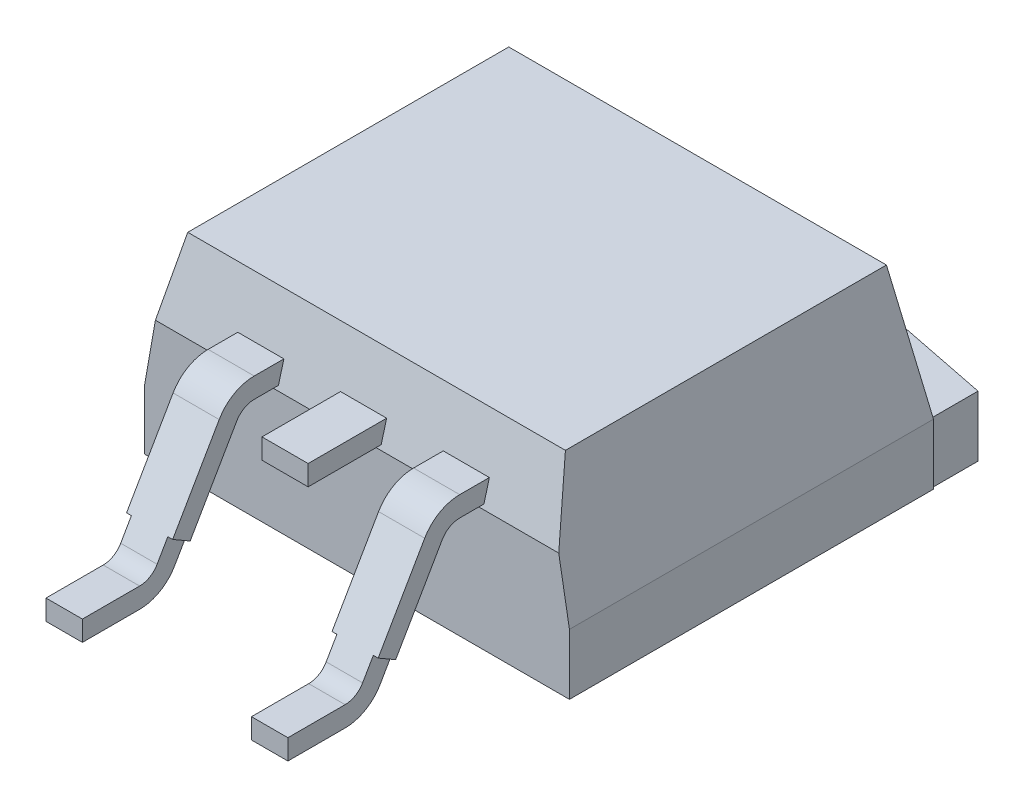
ISO-10303-21;
HEADER;
FILE_DESCRIPTION(('STEP AP214'),'2;1');
FILE_NAME('part.step','',(''),(''),'','','');
FILE_SCHEMA(('AUTOMOTIVE_DESIGN { 1 0 10303 214 1 1 1 1 }'));
ENDSEC;
DATA;
#1=APPLICATION_CONTEXT('core data for automotive mechanical design processes');
#2=APPLICATION_PROTOCOL_DEFINITION('international standard','automotive_design',2000,#1);
#3=PRODUCT_CONTEXT('',#1,'mechanical');
#4=PRODUCT('Part','Part','',(#3));
#5=PRODUCT_RELATED_PRODUCT_CATEGORY('part','',(#4));
#6=PRODUCT_DEFINITION_FORMATION('','',#4);
#7=PRODUCT_DEFINITION_CONTEXT('part definition',#1,'design');
#8=PRODUCT_DEFINITION('design','',#6,#7);
#9=PRODUCT_DEFINITION_SHAPE('','',#8);
#10=(LENGTH_UNIT() NAMED_UNIT(*) SI_UNIT(.MILLI.,.METRE.));
#11=(NAMED_UNIT(*) PLANE_ANGLE_UNIT() SI_UNIT($,.RADIAN.));
#12=(NAMED_UNIT(*) SI_UNIT($,.STERADIAN.) SOLID_ANGLE_UNIT());
#13=UNCERTAINTY_MEASURE_WITH_UNIT(LENGTH_MEASURE(1.E-05),#10,'distance_accuracy_value','');
#14=(GEOMETRIC_REPRESENTATION_CONTEXT(3) GLOBAL_UNCERTAINTY_ASSIGNED_CONTEXT((#13)) GLOBAL_UNIT_ASSIGNED_CONTEXT((#10,
#11,#12)) REPRESENTATION_CONTEXT('',''));
#15=CARTESIAN_POINT('',(0.,0.,0.));
#16=DIRECTION('',(0.,0.,1.));
#17=DIRECTION('',(1.,0.,0.));
#18=AXIS2_PLACEMENT_3D('',#15,#16,#17);
#19=CARTESIAN_POINT('',(-5.25,4.9,1.21769145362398));
#20=DIRECTION('',(0.,-0.258819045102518,-0.965925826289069));
#21=DIRECTION('',(0.,0.965925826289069,-0.258819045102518));
#22=AXIS2_PLACEMENT_3D('',#19,#20,#21);
#23=PLANE('',#22);
#24=DIRECTION('',(0.,-0.965925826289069,0.258819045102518));
#25=VECTOR('',#24,1.);
#26=CARTESIAN_POINT('',(-1.97,4.9,1.21769145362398));
#27=LINE('',#26,#25);
#28=CARTESIAN_POINT('',(-1.97,3.2,1.67320508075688));
#29=VERTEX_POINT('',#28);
#30=CARTESIAN_POINT('',(-1.97,3.7,1.53923048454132));
#31=VERTEX_POINT('',#30);
#32=EDGE_CURVE('E976',#29,#31,#27,.F.);
#33=ORIENTED_EDGE('',*,*,#32,.F.);
#34=DIRECTION('',(1.,0.,0.));
#35=VECTOR('',#34,1.);
#36=CARTESIAN_POINT('',(-5.25,3.2,1.67320508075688));
#37=LINE('',#36,#35);
#38=CARTESIAN_POINT('',(-3.11,3.2,1.67320508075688));
#39=VERTEX_POINT('',#38);
#40=EDGE_CURVE('E962',#29,#39,#37,.F.);
#41=ORIENTED_EDGE('',*,*,#40,.T.);
#42=DIRECTION('',(0.,-0.965925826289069,0.258819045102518));
#43=VECTOR('',#42,1.);
#44=CARTESIAN_POINT('',(-3.11,4.9,1.21769145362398));
#45=LINE('',#44,#43);
#46=CARTESIAN_POINT('',(-3.11,3.7,1.53923048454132));
#47=VERTEX_POINT('',#46);
#48=EDGE_CURVE('E972',#39,#47,#45,.F.);
#49=ORIENTED_EDGE('',*,*,#48,.T.);
#50=DIRECTION('',(-1.,0.,0.));
#51=VECTOR('',#50,1.);
#52=CARTESIAN_POINT('',(-5.25,3.7,1.53923048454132));
#53=LINE('',#52,#51);
#54=EDGE_CURVE('E965',#47,#31,#53,.F.);
#55=ORIENTED_EDGE('',*,*,#54,.T.);
#56=EDGE_LOOP('',(#33,#41,#49,#55));
#57=FACE_BOUND('',#56,.T.);
#58=DIRECTION('',(0.167900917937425,0.952213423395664,-0.25514481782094));
#59=VECTOR('',#58,1.);
#60=CARTESIAN_POINT('',(-4.68878260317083,4.78282201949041,1.24908919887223));
#61=LINE('',#60,#59);
#62=CARTESIAN_POINT('',(-4.9855095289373,3.09999999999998,1.7));
#63=VERTEX_POINT('',#62);
#64=CARTESIAN_POINT('',(-4.66812096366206,4.9,1.21769145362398));
#65=VERTEX_POINT('',#64);
#66=EDGE_CURVE('E959',#63,#65,#61,.T.);
#67=ORIENTED_EDGE('',*,*,#66,.F.);
#68=DIRECTION('',(-1.,0.,0.));
#69=VECTOR('',#68,1.);
#70=CARTESIAN_POINT('',(-5.25,3.09999999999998,1.7));
#71=LINE('',#70,#69);
#72=CARTESIAN_POINT('',(4.9855095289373,3.09999999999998,1.7));
#73=VERTEX_POINT('',#72);
#74=EDGE_CURVE('E956',#73,#63,#71,.T.);
#75=ORIENTED_EDGE('',*,*,#74,.F.);
#76=DIRECTION('',(0.167900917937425,-0.952213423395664,0.25514481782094));
#77=VECTOR('',#76,1.);
#78=CARTESIAN_POINT('',(4.68878260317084,4.78282201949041,1.24908919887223));
#79=LINE('',#78,#77);
#80=CARTESIAN_POINT('',(4.66812096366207,4.9,1.21769145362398));
#81=VERTEX_POINT('',#80);
#82=EDGE_CURVE('E953',#81,#73,#79,.T.);
#83=ORIENTED_EDGE('',*,*,#82,.F.);
#84=DIRECTION('',(1.,0.,0.));
#85=VECTOR('',#84,1.);
#86=CARTESIAN_POINT('',(-5.25,4.9,1.21769145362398));
#87=LINE('',#86,#85);
#88=EDGE_CURVE('E944',#65,#81,#87,.T.);
#89=ORIENTED_EDGE('',*,*,#88,.F.);
#90=EDGE_LOOP('',(#67,#75,#83,#89));
#91=FACE_BOUND('',#90,.T.);
#92=DIRECTION('',(0.,0.965925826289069,-0.258819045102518));
#93=VECTOR('',#92,1.);
#94=CARTESIAN_POINT('',(1.97,4.9,1.21769145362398));
#95=LINE('',#94,#93);
#96=CARTESIAN_POINT('',(1.97,3.7,1.53923048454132));
#97=VERTEX_POINT('',#96);
#98=CARTESIAN_POINT('',(1.97,3.2,1.67320508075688));
#99=VERTEX_POINT('',#98);
#100=EDGE_CURVE('E991',#97,#99,#95,.F.);
#101=ORIENTED_EDGE('',*,*,#100,.F.);
#102=DIRECTION('',(1.,0.,0.));
#103=VECTOR('',#102,1.);
#104=CARTESIAN_POINT('',(-5.25,3.7,1.53923048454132));
#105=LINE('',#104,#103);
#106=CARTESIAN_POINT('',(3.11,3.7,1.53923048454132));
#107=VERTEX_POINT('',#106);
#108=EDGE_CURVE('E980',#107,#97,#105,.F.);
#109=ORIENTED_EDGE('',*,*,#108,.F.);
#110=DIRECTION('',(0.,0.965925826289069,-0.258819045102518));
#111=VECTOR('',#110,1.);
#112=CARTESIAN_POINT('',(3.11,4.9,1.21769145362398));
#113=LINE('',#112,#111);
#114=CARTESIAN_POINT('',(3.11,3.2,1.67320508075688));
#115=VERTEX_POINT('',#114);
#116=EDGE_CURVE('E988',#107,#115,#113,.F.);
#117=ORIENTED_EDGE('',*,*,#116,.T.);
#118=DIRECTION('',(-1.,0.,0.));
#119=VECTOR('',#118,1.);
#120=CARTESIAN_POINT('',(-5.25,3.2,1.67320508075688));
#121=LINE('',#120,#119);
#122=EDGE_CURVE('E59',#99,#115,#121,.F.);
#123=ORIENTED_EDGE('',*,*,#122,.F.);
#124=EDGE_LOOP('',(#101,#109,#117,#123));
#125=FACE_BOUND('',#124,.T.);
#126=DIRECTION('',(1.,0.,0.));
#127=VECTOR('',#126,1.);
#128=CARTESIAN_POINT('',(-5.25,3.2,1.67320508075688));
#129=LINE('',#128,#127);
#130=CARTESIAN_POINT('',(0.57,3.2,1.67320508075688));
#131=VERTEX_POINT('',#130);
#132=CARTESIAN_POINT('',(-0.57,3.2,1.67320508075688));
#133=VERTEX_POINT('',#132);
#134=EDGE_CURVE('E44',#131,#133,#129,.F.);
#135=ORIENTED_EDGE('',*,*,#134,.T.);
#136=DIRECTION('',(0.,-0.965925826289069,0.258819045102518));
#137=VECTOR('',#136,1.);
#138=CARTESIAN_POINT('',(-0.57,4.9,1.21769145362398));
#139=LINE('',#138,#137);
#140=CARTESIAN_POINT('',(-0.57,3.7,1.53923048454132));
#141=VERTEX_POINT('',#140);
#142=EDGE_CURVE('E12',#133,#141,#139,.F.);
#143=ORIENTED_EDGE('',*,*,#142,.T.);
#144=DIRECTION('',(-1.,0.,0.));
#145=VECTOR('',#144,1.);
#146=CARTESIAN_POINT('',(-5.25,3.7,1.53923048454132));
#147=LINE('',#146,#145);
#148=CARTESIAN_POINT('',(0.57,3.7,1.53923048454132));
#149=VERTEX_POINT('',#148);
#150=EDGE_CURVE('E995',#141,#149,#147,.F.);
#151=ORIENTED_EDGE('',*,*,#150,.T.);
#152=DIRECTION('',(0.,0.965925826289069,-0.258819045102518));
#153=VECTOR('',#152,1.);
#154=CARTESIAN_POINT('',(0.569999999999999,4.9,1.21769145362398));
#155=LINE('',#154,#153);
#156=EDGE_CURVE('E999',#149,#131,#155,.F.);
#157=ORIENTED_EDGE('',*,*,#156,.T.);
#158=EDGE_LOOP('',(#135,#143,#151,#157));
#159=FACE_BOUND('',#158,.T.);
#160=ADVANCED_FACE('F36',(#57,#91,#125,#159),#23,.F.);
#161=CARTESIAN_POINT('',(-2.09,2.7,2.27247913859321));
#162=DIRECTION('',(1.,0.,0.));
#163=DIRECTION('',(0.,0.,-1.));
#164=AXIS2_PLACEMENT_3D('',#161,#162,#163);
#165=PLANE('',#164);
#166=DIRECTION('',(0.,0.86602540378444,-0.499999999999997));
#167=VECTOR('',#166,1.);
#168=CARTESIAN_POINT('',(-2.09,2.95,2.70549184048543));
#169=LINE('',#168,#167);
#170=CARTESIAN_POINT('',(-2.09,0.500000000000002,4.12));
#171=VERTEX_POINT('',#170);
#172=CARTESIAN_POINT('',(-2.09,0.958141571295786,3.85549184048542));
#173=VERTEX_POINT('',#172);
#174=EDGE_CURVE('E677',#171,#173,#169,.T.);
#175=ORIENTED_EDGE('',*,*,#174,.T.);
#176=DIRECTION('',(0.,0.5,0.866025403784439));
#177=VECTOR('',#176,1.);
#178=CARTESIAN_POINT('',(-2.09,0.708141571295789,3.42247913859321));
#179=LINE('',#178,#177);
#180=CARTESIAN_POINT('',(-2.09,1.20814157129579,4.28850454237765));
#181=VERTEX_POINT('',#180);
#182=EDGE_CURVE('E653',#173,#181,#179,.T.);
#183=ORIENTED_EDGE('',*,*,#182,.T.);
#184=DIRECTION('',(0.,-0.866025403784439,0.5));
#185=VECTOR('',#184,1.);
#186=CARTESIAN_POINT('',(-2.09,3.2,3.13850454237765));
#187=LINE('',#186,#185);
#188=CARTESIAN_POINT('',(-2.09,0.750000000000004,4.55301270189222));
#189=VERTEX_POINT('',#188);
#190=EDGE_CURVE('E658',#181,#189,#187,.T.);
#191=ORIENTED_EDGE('',*,*,#190,.T.);
#192=CARTESIAN_POINT('',(-2.09,1.,4.98602540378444));
#193=DIRECTION('',(-1.,0.,0.));
#194=DIRECTION('',(0.,0.,1.));
#195=AXIS2_PLACEMENT_3D('',#192,#193,#194);
#196=CIRCLE('',#195,0.499999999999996);
#197=CARTESIAN_POINT('',(-2.09,0.5,4.98602540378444));
#198=VERTEX_POINT('',#197);
#199=EDGE_CURVE('E661',#189,#198,#196,.T.);
#200=ORIENTED_EDGE('',*,*,#199,.T.);
#201=DIRECTION('',(0.,0.,1.));
#202=VECTOR('',#201,1.);
#203=CARTESIAN_POINT('',(-2.09,0.5,4.98602540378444));
#204=LINE('',#203,#202);
#205=CARTESIAN_POINT('',(-2.09,0.5,6.4));
#206=VERTEX_POINT('',#205);
#207=EDGE_CURVE('E665',#198,#206,#204,.T.);
#208=ORIENTED_EDGE('',*,*,#207,.T.);
#209=DIRECTION('',(0.,-1.,0.));
#210=VECTOR('',#209,1.);
#211=CARTESIAN_POINT('',(-2.09,0.,6.4));
#212=LINE('',#211,#210);
#213=CARTESIAN_POINT('',(-2.09,0.,6.4));
#214=VERTEX_POINT('',#213);
#215=EDGE_CURVE('E668',#206,#214,#212,.T.);
#216=ORIENTED_EDGE('',*,*,#215,.T.);
#217=DIRECTION('',(0.,0.,-1.));
#218=VECTOR('',#217,1.);
#219=CARTESIAN_POINT('',(-2.09,0.,4.98602540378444));
#220=LINE('',#219,#218);
#221=CARTESIAN_POINT('',(-2.09,0.,4.98602540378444));
#222=VERTEX_POINT('',#221);
#223=EDGE_CURVE('E671',#214,#222,#220,.T.);
#224=ORIENTED_EDGE('',*,*,#223,.T.);
#225=CARTESIAN_POINT('',(-2.09,1.,4.98602540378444));
#226=DIRECTION('',(1.,0.,0.));
#227=DIRECTION('',(0.,0.,1.));
#228=AXIS2_PLACEMENT_3D('',#225,#226,#227);
#229=CIRCLE('',#228,1.);
#230=EDGE_CURVE('E674',#222,#171,#229,.T.);
#231=ORIENTED_EDGE('',*,*,#230,.T.);
#232=EDGE_LOOP('',(#175,#183,#191,#200,#208,#216,#224,#231));
#233=FACE_BOUND('',#232,.T.);
#234=ADVANCED_FACE('F1174',(#233),#165,.T.);
#235=CARTESIAN_POINT('',(-2.99,2.7,2.27247913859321));
#236=DIRECTION('',(1.,0.,0.));
#237=DIRECTION('',(0.,0.,-1.));
#238=AXIS2_PLACEMENT_3D('',#235,#236,#237);
#239=PLANE('',#238);
#240=DIRECTION('',(0.,0.5,0.866025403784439));
#241=VECTOR('',#240,1.);
#242=CARTESIAN_POINT('',(-2.99,0.708141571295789,3.42247913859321));
#243=LINE('',#242,#241);
#244=CARTESIAN_POINT('',(-2.99,0.958141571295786,3.85549184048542));
#245=VERTEX_POINT('',#244);
#246=CARTESIAN_POINT('',(-2.99,1.20814157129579,4.28850454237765));
#247=VERTEX_POINT('',#246);
#248=EDGE_CURVE('E968',#245,#247,#243,.T.);
#249=ORIENTED_EDGE('',*,*,#248,.F.);
#250=DIRECTION('',(0.,0.86602540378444,-0.499999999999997));
#251=VECTOR('',#250,1.);
#252=CARTESIAN_POINT('',(-2.99,2.95,2.70549184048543));
#253=LINE('',#252,#251);
#254=CARTESIAN_POINT('',(-2.99,0.500000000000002,4.12));
#255=VERTEX_POINT('',#254);
#256=EDGE_CURVE('E662',#255,#245,#253,.T.);
#257=ORIENTED_EDGE('',*,*,#256,.F.);
#258=CARTESIAN_POINT('',(-2.99,1.,4.98602540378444));
#259=DIRECTION('',(1.,0.,0.));
#260=DIRECTION('',(0.,0.,1.));
#261=AXIS2_PLACEMENT_3D('',#258,#259,#260);
#262=CIRCLE('',#261,1.);
#263=CARTESIAN_POINT('',(-2.99,0.,4.98602540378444));
#264=VERTEX_POINT('',#263);
#265=EDGE_CURVE('E696',#264,#255,#262,.T.);
#266=ORIENTED_EDGE('',*,*,#265,.F.);
#267=DIRECTION('',(0.,0.,-1.));
#268=VECTOR('',#267,1.);
#269=CARTESIAN_POINT('',(-2.99,0.,4.98602540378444));
#270=LINE('',#269,#268);
#271=CARTESIAN_POINT('',(-2.99,0.,6.4));
#272=VERTEX_POINT('',#271);
#273=EDGE_CURVE('E693',#272,#264,#270,.T.);
#274=ORIENTED_EDGE('',*,*,#273,.F.);
#275=DIRECTION('',(0.,-1.,0.));
#276=VECTOR('',#275,1.);
#277=CARTESIAN_POINT('',(-2.99,0.,6.4));
#278=LINE('',#277,#276);
#279=CARTESIAN_POINT('',(-2.99,0.5,6.4));
#280=VERTEX_POINT('',#279);
#281=EDGE_CURVE('E690',#280,#272,#278,.T.);
#282=ORIENTED_EDGE('',*,*,#281,.F.);
#283=DIRECTION('',(0.,0.,1.));
#284=VECTOR('',#283,1.);
#285=CARTESIAN_POINT('',(-2.99,0.5,4.98602540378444));
#286=LINE('',#285,#284);
#287=CARTESIAN_POINT('',(-2.99,0.5,4.98602540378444));
#288=VERTEX_POINT('',#287);
#289=EDGE_CURVE('E687',#288,#280,#286,.T.);
#290=ORIENTED_EDGE('',*,*,#289,.F.);
#291=CARTESIAN_POINT('',(-2.99,1.,4.98602540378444));
#292=DIRECTION('',(-1.,0.,0.));
#293=DIRECTION('',(0.,0.,1.));
#294=AXIS2_PLACEMENT_3D('',#291,#292,#293);
#295=CIRCLE('',#294,0.499999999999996);
#296=CARTESIAN_POINT('',(-2.99,0.750000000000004,4.55301270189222));
#297=VERTEX_POINT('',#296);
#298=EDGE_CURVE('E684',#297,#288,#295,.T.);
#299=ORIENTED_EDGE('',*,*,#298,.F.);
#300=DIRECTION('',(0.,-0.866025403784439,0.5));
#301=VECTOR('',#300,1.);
#302=CARTESIAN_POINT('',(-2.99,3.2,3.13850454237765));
#303=LINE('',#302,#301);
#304=EDGE_CURVE('E657',#247,#297,#303,.T.);
#305=ORIENTED_EDGE('',*,*,#304,.F.);
#306=EDGE_LOOP('',(#249,#257,#266,#274,#282,#290,#299,#305));
#307=FACE_BOUND('',#306,.T.);
#308=ADVANCED_FACE('F1179',(#307),#239,.F.);
#309=CARTESIAN_POINT('',(-5.25,4.9,-7.3));
#310=DIRECTION('',(0.,0.,1.));
#311=DIRECTION('',(1.,0.,0.));
#312=AXIS2_PLACEMENT_3D('',#309,#310,#311);
#313=PLANE('',#312);
#314=DIRECTION('',(0.,-1.,0.));
#315=VECTOR('',#314,1.);
#316=CARTESIAN_POINT('',(-5.25,4.9,-7.3));
#317=LINE('',#316,#315);
#318=CARTESIAN_POINT('',(-5.25,1.59999999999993,-7.3));
#319=VERTEX_POINT('',#318);
#320=CARTESIAN_POINT('',(-5.25,0.1,-7.3));
#321=VERTEX_POINT('',#320);
#322=EDGE_CURVE('E1016',#319,#321,#317,.T.);
#323=ORIENTED_EDGE('',*,*,#322,.F.);
#324=DIRECTION('',(1.,0.,0.));
#325=VECTOR('',#324,1.);
#326=CARTESIAN_POINT('',(-5.25,1.59999999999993,-7.3));
#327=LINE('',#326,#325);
#328=CARTESIAN_POINT('',(-5.2,1.6,-7.3));
#329=VERTEX_POINT('',#328);
#330=EDGE_CURVE('E938',#319,#329,#327,.T.);
#331=ORIENTED_EDGE('',*,*,#330,.T.);
#332=DIRECTION('',(0.,-1.,0.));
#333=VECTOR('',#332,1.);
#334=CARTESIAN_POINT('',(-5.2,1.6,-7.3));
#335=LINE('',#334,#333);
#336=CARTESIAN_POINT('',(-5.2,0.2,-7.3));
#337=VERTEX_POINT('',#336);
#338=EDGE_CURVE('E898',#329,#337,#335,.T.);
#339=ORIENTED_EDGE('',*,*,#338,.T.);
#340=DIRECTION('',(-1.,0.,0.));
#341=VECTOR('',#340,1.);
#342=CARTESIAN_POINT('',(-5.2,0.2,-7.3));
#343=LINE('',#342,#341);
#344=CARTESIAN_POINT('',(-4.5,0.2,-7.3));
#345=VERTEX_POINT('',#344);
#346=EDGE_CURVE('E738',#345,#337,#343,.T.);
#347=ORIENTED_EDGE('',*,*,#346,.F.);
#348=DIRECTION('',(0.,-1.,0.));
#349=VECTOR('',#348,1.);
#350=CARTESIAN_POINT('',(-4.5,0.2,-7.3));
#351=LINE('',#350,#349);
#352=CARTESIAN_POINT('',(-4.5,0.1,-7.3));
#353=VERTEX_POINT('',#352);
#354=EDGE_CURVE('E814',#345,#353,#351,.T.);
#355=ORIENTED_EDGE('',*,*,#354,.T.);
#356=DIRECTION('',(-1.,0.,0.));
#357=VECTOR('',#356,1.);
#358=CARTESIAN_POINT('',(-5.25,0.1,-7.3));
#359=LINE('',#358,#357);
#360=EDGE_CURVE('E1056',#353,#321,#359,.T.);
#361=ORIENTED_EDGE('',*,*,#360,.T.);
#362=EDGE_LOOP('',(#323,#331,#339,#347,#355,#361));
#363=FACE_BOUND('',#362,.T.);
#364=ADVANCED_FACE('F1107',(#363),#313,.F.);
#365=CARTESIAN_POINT('',(-5.25,0.1,1.7));
#366=DIRECTION('',(0.,-1.,0.));
#367=DIRECTION('',(0.,0.,-1.));
#368=AXIS2_PLACEMENT_3D('',#365,#366,#367);
#369=PLANE('',#368);
#370=DIRECTION('',(0.,0.,-1.));
#371=VECTOR('',#370,1.);
#372=CARTESIAN_POINT('',(5.2,0.1,-7.3));
#373=LINE('',#372,#371);
#374=CARTESIAN_POINT('',(5.2,0.1,-7.35));
#375=VERTEX_POINT('',#374);
#376=CARTESIAN_POINT('',(5.2,0.1,-8.45));
#377=VERTEX_POINT('',#376);
#378=EDGE_CURVE('E872',#375,#377,#373,.T.);
#379=ORIENTED_EDGE('',*,*,#378,.F.);
#380=DIRECTION('',(1.,0.,0.));
#381=VECTOR('',#380,1.);
#382=CARTESIAN_POINT('',(5.2,0.1,-7.35));
#383=LINE('',#382,#381);
#384=CARTESIAN_POINT('',(4.45,0.1,-7.35));
#385=VERTEX_POINT('',#384);
#386=EDGE_CURVE('E799',#375,#385,#383,.F.);
#387=ORIENTED_EDGE('',*,*,#386,.T.);
#388=DIRECTION('',(0.,0.,1.));
#389=VECTOR('',#388,1.);
#390=CARTESIAN_POINT('',(4.45,0.1,-7.3));
#391=LINE('',#390,#389);
#392=CARTESIAN_POINT('',(4.45,0.1,-2.));
#393=VERTEX_POINT('',#392);
#394=EDGE_CURVE('E795',#385,#393,#391,.T.);
#395=ORIENTED_EDGE('',*,*,#394,.T.);
#396=DIRECTION('',(1.,0.,0.));
#397=VECTOR('',#396,1.);
#398=CARTESIAN_POINT('',(-4.5,0.1,-2.));
#399=LINE('',#398,#397);
#400=CARTESIAN_POINT('',(-4.45,0.1,-2.));
#401=VERTEX_POINT('',#400);
#402=EDGE_CURVE('E791',#393,#401,#399,.F.);
#403=ORIENTED_EDGE('',*,*,#402,.T.);
#404=DIRECTION('',(0.,0.,-1.));
#405=VECTOR('',#404,1.);
#406=CARTESIAN_POINT('',(-4.45,0.1,-7.3));
#407=LINE('',#406,#405);
#408=CARTESIAN_POINT('',(-4.45,0.1,-7.35));
#409=VERTEX_POINT('',#408);
#410=EDGE_CURVE('E786',#401,#409,#407,.T.);
#411=ORIENTED_EDGE('',*,*,#410,.T.);
#412=DIRECTION('',(1.,0.,0.));
#413=VECTOR('',#412,1.);
#414=CARTESIAN_POINT('',(-5.2,0.1,-7.35));
#415=LINE('',#414,#413);
#416=CARTESIAN_POINT('',(-5.2,0.1,-7.35));
#417=VERTEX_POINT('',#416);
#418=EDGE_CURVE('E782',#409,#417,#415,.F.);
#419=ORIENTED_EDGE('',*,*,#418,.T.);
#420=DIRECTION('',(0.,0.,1.));
#421=VECTOR('',#420,1.);
#422=CARTESIAN_POINT('',(-5.2,0.1,-7.3));
#423=LINE('',#422,#421);
#424=CARTESIAN_POINT('',(-5.2,0.1,-8.45));
#425=VERTEX_POINT('',#424);
#426=EDGE_CURVE('E818',#425,#417,#423,.T.);
#427=ORIENTED_EDGE('',*,*,#426,.F.);
#428=DIRECTION('',(-0.98058067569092,0.,0.196116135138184));
#429=VECTOR('',#428,1.);
#430=CARTESIAN_POINT('',(-5.2,0.1,-8.45));
#431=LINE('',#430,#429);
#432=CARTESIAN_POINT('',(-2.7,0.1,-8.95));
#433=VERTEX_POINT('',#432);
#434=EDGE_CURVE('E852',#433,#425,#431,.T.);
#435=ORIENTED_EDGE('',*,*,#434,.F.);
#436=DIRECTION('',(-1.,0.,0.));
#437=VECTOR('',#436,1.);
#438=CARTESIAN_POINT('',(-2.7,0.1,-8.95));
#439=LINE('',#438,#437);
#440=CARTESIAN_POINT('',(2.7,0.1,-8.95));
#441=VERTEX_POINT('',#440);
#442=EDGE_CURVE('E871',#441,#433,#439,.T.);
#443=ORIENTED_EDGE('',*,*,#442,.F.);
#444=DIRECTION('',(-0.98058067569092,0.,-0.196116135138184));
#445=VECTOR('',#444,1.);
#446=CARTESIAN_POINT('',(2.7,0.1,-8.95));
#447=LINE('',#446,#445);
#448=EDGE_CURVE('E868',#377,#441,#447,.T.);
#449=ORIENTED_EDGE('',*,*,#448,.F.);
#450=EDGE_LOOP('',(#379,#387,#395,#403,#411,#419,#427,#435,#443,#449));
#451=FACE_BOUND('',#450,.T.);
#452=ADVANCED_FACE('F1133',(#451),#369,.T.);
#453=CARTESIAN_POINT('',(-5.2,1.6,-7.3));
#454=DIRECTION('',(1.,0.,0.));
#455=DIRECTION('',(0.,0.,-1.));
#456=AXIS2_PLACEMENT_3D('',#453,#454,#455);
#457=PLANE('',#456);
#458=DIRECTION('',(0.,-1.,0.));
#459=VECTOR('',#458,1.);
#460=CARTESIAN_POINT('',(-5.2,0.2,-7.35));
#461=LINE('',#460,#459);
#462=CARTESIAN_POINT('',(-5.2,0.2,-7.35));
#463=VERTEX_POINT('',#462);
#464=EDGE_CURVE('E781',#463,#417,#461,.T.);
#465=ORIENTED_EDGE('',*,*,#464,.F.);
#466=DIRECTION('',(0.,0.,1.));
#467=VECTOR('',#466,1.);
#468=CARTESIAN_POINT('',(-5.2,0.2,-7.35));
#469=LINE('',#468,#467);
#470=EDGE_CURVE('E741',#463,#337,#469,.T.);
#471=ORIENTED_EDGE('',*,*,#470,.T.);
#472=ORIENTED_EDGE('',*,*,#338,.F.);
#473=DIRECTION('',(0.,0.,1.));
#474=VECTOR('',#473,1.);
#475=CARTESIAN_POINT('',(-5.2,1.6,-7.3));
#476=LINE('',#475,#474);
#477=CARTESIAN_POINT('',(-5.2,1.6,-8.45));
#478=VERTEX_POINT('',#477);
#479=EDGE_CURVE('E847',#478,#329,#476,.T.);
#480=ORIENTED_EDGE('',*,*,#479,.F.);
#481=DIRECTION('',(0.,-1.,0.));
#482=VECTOR('',#481,1.);
#483=CARTESIAN_POINT('',(-5.2,1.6,-8.45));
#484=LINE('',#483,#482);
#485=EDGE_CURVE('E867',#478,#425,#484,.T.);
#486=ORIENTED_EDGE('',*,*,#485,.T.);
#487=ORIENTED_EDGE('',*,*,#426,.T.);
#488=EDGE_LOOP('',(#465,#471,#472,#480,#486,#487));
#489=FACE_BOUND('',#488,.T.);
#490=ADVANCED_FACE('F1151',(#489),#457,.F.);
#491=CARTESIAN_POINT('',(5.2,1.6,-7.3));
#492=DIRECTION('',(-1.,0.,0.));
#493=DIRECTION('',(0.,0.,1.));
#494=AXIS2_PLACEMENT_3D('',#491,#492,#493);
#495=PLANE('',#494);
#496=DIRECTION('',(0.,-1.,0.));
#497=VECTOR('',#496,1.);
#498=CARTESIAN_POINT('',(5.2,0.2,-7.35));
#499=LINE('',#498,#497);
#500=CARTESIAN_POINT('',(5.2,0.2,-7.35));
#501=VERTEX_POINT('',#500);
#502=EDGE_CURVE('E829',#501,#375,#499,.T.);
#503=ORIENTED_EDGE('',*,*,#502,.T.);
#504=ORIENTED_EDGE('',*,*,#378,.T.);
#505=DIRECTION('',(0.,-1.,0.));
#506=VECTOR('',#505,1.);
#507=CARTESIAN_POINT('',(5.2,1.6,-8.45));
#508=LINE('',#507,#506);
#509=CARTESIAN_POINT('',(5.2,1.6,-8.45));
#510=VERTEX_POINT('',#509);
#511=EDGE_CURVE('E888',#510,#377,#508,.T.);
#512=ORIENTED_EDGE('',*,*,#511,.F.);
#513=DIRECTION('',(0.,0.,-1.));
#514=VECTOR('',#513,1.);
#515=CARTESIAN_POINT('',(5.2,1.6,-7.3));
#516=LINE('',#515,#514);
#517=CARTESIAN_POINT('',(5.2,1.6,-7.3));
#518=VERTEX_POINT('',#517);
#519=EDGE_CURVE('E855',#518,#510,#516,.T.);
#520=ORIENTED_EDGE('',*,*,#519,.F.);
#521=DIRECTION('',(0.,-1.,0.));
#522=VECTOR('',#521,1.);
#523=CARTESIAN_POINT('',(5.2,1.6,-7.3));
#524=LINE('',#523,#522);
#525=CARTESIAN_POINT('',(5.2,0.2,-7.3));
#526=VERTEX_POINT('',#525);
#527=EDGE_CURVE('E892',#518,#526,#524,.T.);
#528=ORIENTED_EDGE('',*,*,#527,.T.);
#529=DIRECTION('',(0.,0.,-1.));
#530=VECTOR('',#529,1.);
#531=CARTESIAN_POINT('',(5.2,0.2,-7.3));
#532=LINE('',#531,#530);
#533=EDGE_CURVE('E761',#526,#501,#532,.T.);
#534=ORIENTED_EDGE('',*,*,#533,.T.);
#535=EDGE_LOOP('',(#503,#504,#512,#520,#528,#534));
#536=FACE_BOUND('',#535,.T.);
#537=ADVANCED_FACE('F1120',(#536),#495,.F.);
#538=ORIENTED_EDGE('',*,*,#527,.F.);
#539=DIRECTION('',(1.,0.,0.));
#540=VECTOR('',#539,1.);
#541=CARTESIAN_POINT('',(-5.25,1.59999999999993,-7.3));
#542=LINE('',#541,#540);
#543=CARTESIAN_POINT('',(5.25,1.59999999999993,-7.3));
#544=VERTEX_POINT('',#543);
#545=EDGE_CURVE('E935',#518,#544,#542,.T.);
#546=ORIENTED_EDGE('',*,*,#545,.T.);
#547=DIRECTION('',(0.,-1.,0.));
#548=VECTOR('',#547,1.);
#549=CARTESIAN_POINT('',(5.25,4.9,-7.3));
#550=LINE('',#549,#548);
#551=CARTESIAN_POINT('',(5.25,0.1,-7.3));
#552=VERTEX_POINT('',#551);
#553=EDGE_CURVE('E1017',#544,#552,#550,.T.);
#554=ORIENTED_EDGE('',*,*,#553,.T.);
#555=CARTESIAN_POINT('',(4.5,0.1,-7.3));
#556=VERTEX_POINT('',#555);
#557=EDGE_CURVE('E1018',#552,#556,#359,.T.);
#558=ORIENTED_EDGE('',*,*,#557,.T.);
#559=DIRECTION('',(0.,-1.,0.));
#560=VECTOR('',#559,1.);
#561=CARTESIAN_POINT('',(4.5,0.2,-7.3));
#562=LINE('',#561,#560);
#563=CARTESIAN_POINT('',(4.5,0.2,-7.3));
#564=VERTEX_POINT('',#563);
#565=EDGE_CURVE('E825',#564,#556,#562,.T.);
#566=ORIENTED_EDGE('',*,*,#565,.F.);
#567=DIRECTION('',(-1.,0.,0.));
#568=VECTOR('',#567,1.);
#569=CARTESIAN_POINT('',(5.2,0.2,-7.3));
#570=LINE('',#569,#568);
#571=EDGE_CURVE('E765',#526,#564,#570,.T.);
#572=ORIENTED_EDGE('',*,*,#571,.F.);
#573=EDGE_LOOP('',(#538,#546,#554,#558,#566,#572));
#574=FACE_BOUND('',#573,.T.);
#575=ADVANCED_FACE('F1123',(#574),#313,.F.);
#576=CARTESIAN_POINT('',(-5.25,4.9,1.7));
#577=DIRECTION('',(1.,0.,0.));
#578=DIRECTION('',(0.,0.,-1.));
#579=AXIS2_PLACEMENT_3D('',#576,#577,#578);
#580=PLANE('',#579);
#581=DIRECTION('',(0.,-1.,0.));
#582=VECTOR('',#581,1.);
#583=CARTESIAN_POINT('',(-5.25,4.9,1.7));
#584=LINE('',#583,#582);
#585=CARTESIAN_POINT('',(-5.25,1.59999999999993,1.7));
#586=VERTEX_POINT('',#585);
#587=CARTESIAN_POINT('',(-5.25,0.1,1.7));
#588=VERTEX_POINT('',#587);
#589=EDGE_CURVE('E918',#586,#588,#584,.T.);
#590=ORIENTED_EDGE('',*,*,#589,.F.);
#591=DIRECTION('',(0.,0.,-1.));
#592=VECTOR('',#591,1.);
#593=CARTESIAN_POINT('',(-5.25,1.59999999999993,1.7));
#594=LINE('',#593,#592);
#595=EDGE_CURVE('E932',#586,#319,#594,.T.);
#596=ORIENTED_EDGE('',*,*,#595,.T.);
#597=ORIENTED_EDGE('',*,*,#322,.T.);
#598=DIRECTION('',(0.,0.,1.));
#599=VECTOR('',#598,1.);
#600=CARTESIAN_POINT('',(-5.25,0.1,1.7));
#601=LINE('',#600,#599);
#602=EDGE_CURVE('E895',#321,#588,#601,.T.);
#603=ORIENTED_EDGE('',*,*,#602,.T.);
#604=EDGE_LOOP('',(#590,#596,#597,#603));
#605=FACE_BOUND('',#604,.T.);
#606=ADVANCED_FACE('F1074',(#605),#580,.F.);
#607=CARTESIAN_POINT('',(-5.25,4.9,1.7));
#608=DIRECTION('',(0.,0.,-1.));
#609=DIRECTION('',(-1.,0.,0.));
#610=AXIS2_PLACEMENT_3D('',#607,#608,#609);
#611=PLANE('',#610);
#612=DIRECTION('',(0.173648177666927,-0.984807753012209,0.));
#613=VECTOR('',#612,1.);
#614=CARTESIAN_POINT('',(4.66812096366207,4.9,1.7));
#615=LINE('',#614,#613);
#616=CARTESIAN_POINT('',(5.25,1.59999999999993,1.7));
#617=VERTEX_POINT('',#616);
#618=EDGE_CURVE('E925',#617,#73,#615,.F.);
#619=ORIENTED_EDGE('',*,*,#618,.T.);
#620=ORIENTED_EDGE('',*,*,#74,.T.);
#621=DIRECTION('',(0.173648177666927,0.984807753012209,0.));
#622=VECTOR('',#621,1.);
#623=CARTESIAN_POINT('',(-4.66812096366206,4.9,1.7));
#624=LINE('',#623,#622);
#625=EDGE_CURVE('E929',#63,#586,#624,.F.);
#626=ORIENTED_EDGE('',*,*,#625,.T.);
#627=ORIENTED_EDGE('',*,*,#589,.T.);
#628=DIRECTION('',(1.,0.,0.));
#629=VECTOR('',#628,1.);
#630=CARTESIAN_POINT('',(-5.25,0.1,1.7));
#631=LINE('',#630,#629);
#632=CARTESIAN_POINT('',(5.25,0.1,1.7));
#633=VERTEX_POINT('',#632);
#634=EDGE_CURVE('E1062',#588,#633,#631,.T.);
#635=ORIENTED_EDGE('',*,*,#634,.T.);
#636=DIRECTION('',(0.,-1.,0.));
#637=VECTOR('',#636,1.);
#638=CARTESIAN_POINT('',(5.25,4.9,1.7));
#639=LINE('',#638,#637);
#640=EDGE_CURVE('E1043',#617,#633,#639,.T.);
#641=ORIENTED_EDGE('',*,*,#640,.F.);
#642=EDGE_LOOP('',(#619,#620,#626,#627,#635,#641));
#643=FACE_BOUND('',#642,.T.);
#644=ADVANCED_FACE('F1087',(#643),#611,.F.);
#645=CARTESIAN_POINT('',(5.25,4.9,1.7));
#646=DIRECTION('',(-1.,0.,0.));
#647=DIRECTION('',(0.,0.,1.));
#648=AXIS2_PLACEMENT_3D('',#645,#646,#647);
#649=PLANE('',#648);
#650=ORIENTED_EDGE('',*,*,#553,.F.);
#651=DIRECTION('',(0.,0.,1.));
#652=VECTOR('',#651,1.);
#653=CARTESIAN_POINT('',(5.25,1.59999999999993,1.7));
#654=LINE('',#653,#652);
#655=EDGE_CURVE('E941',#544,#617,#654,.T.);
#656=ORIENTED_EDGE('',*,*,#655,.T.);
#657=ORIENTED_EDGE('',*,*,#640,.T.);
#658=DIRECTION('',(0.,0.,-1.));
#659=VECTOR('',#658,1.);
#660=CARTESIAN_POINT('',(5.25,0.1,1.7));
#661=LINE('',#660,#659);
#662=EDGE_CURVE('E1059',#633,#552,#661,.T.);
#663=ORIENTED_EDGE('',*,*,#662,.T.);
#664=EDGE_LOOP('',(#650,#656,#657,#663));
#665=FACE_BOUND('',#664,.T.);
#666=ADVANCED_FACE('F1084',(#665),#649,.F.);
#667=CARTESIAN_POINT('',(-5.25,4.9,1.7));
#668=DIRECTION('',(0.,-1.,0.));
#669=DIRECTION('',(0.,0.,-1.));
#670=AXIS2_PLACEMENT_3D('',#667,#668,#669);
#671=PLANE('',#670);
#672=DIRECTION('',(0.,0.,1.));
#673=VECTOR('',#672,1.);
#674=CARTESIAN_POINT('',(-4.66812096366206,4.9,1.7));
#675=LINE('',#674,#673);
#676=CARTESIAN_POINT('',(-4.66812096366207,4.9,-6.71812096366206));
#677=VERTEX_POINT('',#676);
#678=EDGE_CURVE('E921',#677,#65,#675,.T.);
#679=ORIENTED_EDGE('',*,*,#678,.T.);
#680=ORIENTED_EDGE('',*,*,#88,.T.);
#681=DIRECTION('',(0.,0.,-1.));
#682=VECTOR('',#681,1.);
#683=CARTESIAN_POINT('',(4.66812096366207,4.9,1.7));
#684=LINE('',#683,#682);
#685=CARTESIAN_POINT('',(4.66812096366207,4.9,-6.71812096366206));
#686=VERTEX_POINT('',#685);
#687=EDGE_CURVE('E914',#81,#686,#684,.T.);
#688=ORIENTED_EDGE('',*,*,#687,.T.);
#689=DIRECTION('',(-1.,0.,0.));
#690=VECTOR('',#689,1.);
#691=CARTESIAN_POINT('',(-5.25,4.9,-6.71812096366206));
#692=LINE('',#691,#690);
#693=EDGE_CURVE('E917',#686,#677,#692,.T.);
#694=ORIENTED_EDGE('',*,*,#693,.T.);
#695=EDGE_LOOP('',(#679,#680,#688,#694));
#696=FACE_BOUND('',#695,.T.);
#697=ADVANCED_FACE('F1098',(#696),#671,.F.);
#698=ORIENTED_EDGE('',*,*,#360,.F.);
#699=DIRECTION('',(0.,0.,-1.));
#700=VECTOR('',#699,1.);
#701=CARTESIAN_POINT('',(-4.5,0.1,-7.3));
#702=LINE('',#701,#700);
#703=CARTESIAN_POINT('',(-4.5,0.1,-1.95));
#704=VERTEX_POINT('',#703);
#705=EDGE_CURVE('E742',#704,#353,#702,.T.);
#706=ORIENTED_EDGE('',*,*,#705,.F.);
#707=DIRECTION('',(-1.,0.,0.));
#708=VECTOR('',#707,1.);
#709=CARTESIAN_POINT('',(-4.5,0.1,-1.95));
#710=LINE('',#709,#708);
#711=CARTESIAN_POINT('',(4.5,0.1,-1.95));
#712=VERTEX_POINT('',#711);
#713=EDGE_CURVE('E807',#712,#704,#710,.T.);
#714=ORIENTED_EDGE('',*,*,#713,.F.);
#715=DIRECTION('',(0.,0.,1.));
#716=VECTOR('',#715,1.);
#717=CARTESIAN_POINT('',(4.5,0.1,-7.3));
#718=LINE('',#717,#716);
#719=EDGE_CURVE('E803',#556,#712,#718,.T.);
#720=ORIENTED_EDGE('',*,*,#719,.F.);
#721=ORIENTED_EDGE('',*,*,#557,.F.);
#722=ORIENTED_EDGE('',*,*,#662,.F.);
#723=ORIENTED_EDGE('',*,*,#634,.F.);
#724=ORIENTED_EDGE('',*,*,#602,.F.);
#725=EDGE_LOOP('',(#698,#706,#714,#720,#721,#722,#723,#724));
#726=FACE_BOUND('',#725,.T.);
#727=ADVANCED_FACE('F1079',(#726),#369,.T.);
#728=CARTESIAN_POINT('',(2.7,1.6,-8.95));
#729=DIRECTION('',(-0.196116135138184,0.,0.98058067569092));
#730=DIRECTION('',(0.98058067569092,0.,0.196116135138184));
#731=AXIS2_PLACEMENT_3D('',#728,#729,#730);
#732=PLANE('',#731);
#733=ORIENTED_EDGE('',*,*,#448,.T.);
#734=DIRECTION('',(0.,-1.,0.));
#735=VECTOR('',#734,1.);
#736=CARTESIAN_POINT('',(2.7,1.6,-8.95));
#737=LINE('',#736,#735);
#738=CARTESIAN_POINT('',(2.7,1.6,-8.95));
#739=VERTEX_POINT('',#738);
#740=EDGE_CURVE('E884',#739,#441,#737,.T.);
#741=ORIENTED_EDGE('',*,*,#740,.F.);
#742=DIRECTION('',(-0.98058067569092,0.,-0.196116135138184));
#743=VECTOR('',#742,1.);
#744=CARTESIAN_POINT('',(2.7,1.6,-8.95));
#745=LINE('',#744,#743);
#746=EDGE_CURVE('E858',#510,#739,#745,.T.);
#747=ORIENTED_EDGE('',*,*,#746,.F.);
#748=ORIENTED_EDGE('',*,*,#511,.T.);
#749=EDGE_LOOP('',(#733,#741,#747,#748));
#750=FACE_BOUND('',#749,.T.);
#751=ADVANCED_FACE('F1138',(#750),#732,.F.);
#752=CARTESIAN_POINT('',(-2.7,1.6,-8.95));
#753=DIRECTION('',(0.,0.,1.));
#754=DIRECTION('',(1.,0.,0.));
#755=AXIS2_PLACEMENT_3D('',#752,#753,#754);
#756=PLANE('',#755);
#757=ORIENTED_EDGE('',*,*,#442,.T.);
#758=DIRECTION('',(0.,-1.,0.));
#759=VECTOR('',#758,1.);
#760=CARTESIAN_POINT('',(-2.7,1.6,-8.95));
#761=LINE('',#760,#759);
#762=CARTESIAN_POINT('',(-2.7,1.6,-8.95));
#763=VERTEX_POINT('',#762);
#764=EDGE_CURVE('E880',#763,#433,#761,.T.);
#765=ORIENTED_EDGE('',*,*,#764,.F.);
#766=DIRECTION('',(-1.,0.,0.));
#767=VECTOR('',#766,1.);
#768=CARTESIAN_POINT('',(-2.7,1.6,-8.95));
#769=LINE('',#768,#767);
#770=EDGE_CURVE('E861',#739,#763,#769,.T.);
#771=ORIENTED_EDGE('',*,*,#770,.F.);
#772=ORIENTED_EDGE('',*,*,#740,.T.);
#773=EDGE_LOOP('',(#757,#765,#771,#772));
#774=FACE_BOUND('',#773,.T.);
#775=ADVANCED_FACE('F1141',(#774),#756,.F.);
#776=CARTESIAN_POINT('',(-5.2,1.6,-8.45));
#777=DIRECTION('',(0.196116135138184,0.,0.98058067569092));
#778=DIRECTION('',(0.98058067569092,0.,-0.196116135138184));
#779=AXIS2_PLACEMENT_3D('',#776,#777,#778);
#780=PLANE('',#779);
#781=ORIENTED_EDGE('',*,*,#434,.T.);
#782=ORIENTED_EDGE('',*,*,#485,.F.);
#783=DIRECTION('',(-0.98058067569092,0.,0.196116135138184));
#784=VECTOR('',#783,1.);
#785=CARTESIAN_POINT('',(-5.2,1.6,-8.45));
#786=LINE('',#785,#784);
#787=EDGE_CURVE('E864',#763,#478,#786,.T.);
#788=ORIENTED_EDGE('',*,*,#787,.F.);
#789=ORIENTED_EDGE('',*,*,#764,.T.);
#790=EDGE_LOOP('',(#781,#782,#788,#789));
#791=FACE_BOUND('',#790,.T.);
#792=ADVANCED_FACE('F1146',(#791),#780,.F.);
#793=CARTESIAN_POINT('',(-5.2,1.6,-8.95));
#794=DIRECTION('',(0.,-1.,0.));
#795=DIRECTION('',(0.,0.,-1.));
#796=AXIS2_PLACEMENT_3D('',#793,#794,#795);
#797=PLANE('',#796);
#798=ORIENTED_EDGE('',*,*,#479,.T.);
#799=DIRECTION('',(1.,0.,0.));
#800=VECTOR('',#799,1.);
#801=CARTESIAN_POINT('',(-5.2,1.6,-7.3));
#802=LINE('',#801,#800);
#803=EDGE_CURVE('E851',#329,#518,#802,.T.);
#804=ORIENTED_EDGE('',*,*,#803,.T.);
#805=ORIENTED_EDGE('',*,*,#519,.T.);
#806=ORIENTED_EDGE('',*,*,#746,.T.);
#807=ORIENTED_EDGE('',*,*,#770,.T.);
#808=ORIENTED_EDGE('',*,*,#787,.T.);
#809=EDGE_LOOP('',(#798,#804,#805,#806,#807,#808));
#810=FACE_BOUND('',#809,.T.);
#811=ADVANCED_FACE('F1114',(#810),#797,.F.);
#812=CARTESIAN_POINT('',(-4.5,0.2,-7.3));
#813=DIRECTION('',(-1.,0.,0.));
#814=DIRECTION('',(0.,0.,1.));
#815=AXIS2_PLACEMENT_3D('',#812,#813,#814);
#816=PLANE('',#815);
#817=ORIENTED_EDGE('',*,*,#705,.T.);
#818=ORIENTED_EDGE('',*,*,#354,.F.);
#819=DIRECTION('',(0.,0.,-1.));
#820=VECTOR('',#819,1.);
#821=CARTESIAN_POINT('',(-4.5,0.2,-7.3));
#822=LINE('',#821,#820);
#823=CARTESIAN_POINT('',(-4.5,0.2,-1.95));
#824=VERTEX_POINT('',#823);
#825=EDGE_CURVE('E777',#824,#345,#822,.T.);
#826=ORIENTED_EDGE('',*,*,#825,.F.);
#827=DIRECTION('',(0.,-1.,0.));
#828=VECTOR('',#827,1.);
#829=CARTESIAN_POINT('',(-4.5,0.2,-1.95));
#830=LINE('',#829,#828);
#831=EDGE_CURVE('E819',#824,#704,#830,.T.);
#832=ORIENTED_EDGE('',*,*,#831,.T.);
#833=EDGE_LOOP('',(#817,#818,#826,#832));
#834=FACE_BOUND('',#833,.T.);
#835=ADVANCED_FACE('F1157',(#834),#816,.F.);
#836=CARTESIAN_POINT('',(-4.5,0.2,-1.95));
#837=DIRECTION('',(0.,0.,1.));
#838=DIRECTION('',(1.,0.,0.));
#839=AXIS2_PLACEMENT_3D('',#836,#837,#838);
#840=PLANE('',#839);
#841=ORIENTED_EDGE('',*,*,#713,.T.);
#842=ORIENTED_EDGE('',*,*,#831,.F.);
#843=DIRECTION('',(-1.,0.,0.));
#844=VECTOR('',#843,1.);
#845=CARTESIAN_POINT('',(-4.5,0.2,-1.95));
#846=LINE('',#845,#844);
#847=CARTESIAN_POINT('',(4.5,0.2,-1.95));
#848=VERTEX_POINT('',#847);
#849=EDGE_CURVE('E773',#848,#824,#846,.T.);
#850=ORIENTED_EDGE('',*,*,#849,.F.);
#851=DIRECTION('',(0.,-1.,0.));
#852=VECTOR('',#851,1.);
#853=CARTESIAN_POINT('',(4.5,0.2,-1.95));
#854=LINE('',#853,#852);
#855=EDGE_CURVE('E822',#848,#712,#854,.T.);
#856=ORIENTED_EDGE('',*,*,#855,.T.);
#857=EDGE_LOOP('',(#841,#842,#850,#856));
#858=FACE_BOUND('',#857,.T.);
#859=ADVANCED_FACE('F1160',(#858),#840,.F.);
#860=CARTESIAN_POINT('',(4.5,0.2,-7.3));
#861=DIRECTION('',(1.,0.,0.));
#862=DIRECTION('',(0.,0.,-1.));
#863=AXIS2_PLACEMENT_3D('',#860,#861,#862);
#864=PLANE('',#863);
#865=ORIENTED_EDGE('',*,*,#719,.T.);
#866=ORIENTED_EDGE('',*,*,#855,.F.);
#867=DIRECTION('',(0.,0.,1.));
#868=VECTOR('',#867,1.);
#869=CARTESIAN_POINT('',(4.5,0.2,-7.3));
#870=LINE('',#869,#868);
#871=EDGE_CURVE('E769',#564,#848,#870,.T.);
#872=ORIENTED_EDGE('',*,*,#871,.F.);
#873=ORIENTED_EDGE('',*,*,#565,.T.);
#874=EDGE_LOOP('',(#865,#866,#872,#873));
#875=FACE_BOUND('',#874,.T.);
#876=ADVANCED_FACE('F1162',(#875),#864,.F.);
#877=CARTESIAN_POINT('',(5.2,0.2,-7.35));
#878=DIRECTION('',(0.,0.,1.));
#879=DIRECTION('',(1.,0.,0.));
#880=AXIS2_PLACEMENT_3D('',#877,#878,#879);
#881=PLANE('',#880);
#882=ORIENTED_EDGE('',*,*,#386,.F.);
#883=ORIENTED_EDGE('',*,*,#502,.F.);
#884=DIRECTION('',(1.,0.,0.));
#885=VECTOR('',#884,1.);
#886=CARTESIAN_POINT('',(5.2,0.2,-7.35));
#887=LINE('',#886,#885);
#888=CARTESIAN_POINT('',(4.45,0.2,-7.35));
#889=VERTEX_POINT('',#888);
#890=EDGE_CURVE('E758',#501,#889,#887,.F.);
#891=ORIENTED_EDGE('',*,*,#890,.T.);
#892=DIRECTION('',(0.,-1.,0.));
#893=VECTOR('',#892,1.);
#894=CARTESIAN_POINT('',(4.45,0.2,-7.35));
#895=LINE('',#894,#893);
#896=EDGE_CURVE('E833',#889,#385,#895,.T.);
#897=ORIENTED_EDGE('',*,*,#896,.T.);
#898=EDGE_LOOP('',(#882,#883,#891,#897));
#899=FACE_BOUND('',#898,.T.);
#900=ADVANCED_FACE('F1164',(#899),#881,.T.);
#901=CARTESIAN_POINT('',(4.45,0.2,-7.3));
#902=DIRECTION('',(1.,0.,0.));
#903=DIRECTION('',(0.,0.,-1.));
#904=AXIS2_PLACEMENT_3D('',#901,#902,#903);
#905=PLANE('',#904);
#906=ORIENTED_EDGE('',*,*,#394,.F.);
#907=ORIENTED_EDGE('',*,*,#896,.F.);
#908=DIRECTION('',(0.,0.,1.));
#909=VECTOR('',#908,1.);
#910=CARTESIAN_POINT('',(4.45,0.2,-7.3));
#911=LINE('',#910,#909);
#912=CARTESIAN_POINT('',(4.45,0.2,-2.));
#913=VERTEX_POINT('',#912);
#914=EDGE_CURVE('E755',#889,#913,#911,.T.);
#915=ORIENTED_EDGE('',*,*,#914,.T.);
#916=DIRECTION('',(0.,-1.,0.));
#917=VECTOR('',#916,1.);
#918=CARTESIAN_POINT('',(4.45,0.2,-2.));
#919=LINE('',#918,#917);
#920=EDGE_CURVE('E836',#913,#393,#919,.T.);
#921=ORIENTED_EDGE('',*,*,#920,.T.);
#922=EDGE_LOOP('',(#906,#907,#915,#921));
#923=FACE_BOUND('',#922,.T.);
#924=ADVANCED_FACE('F1170',(#923),#905,.T.);
#925=CARTESIAN_POINT('',(-4.5,0.2,-2.));
#926=DIRECTION('',(0.,0.,1.));
#927=DIRECTION('',(1.,0.,0.));
#928=AXIS2_PLACEMENT_3D('',#925,#926,#927);
#929=PLANE('',#928);
#930=ORIENTED_EDGE('',*,*,#402,.F.);
#931=ORIENTED_EDGE('',*,*,#920,.F.);
#932=DIRECTION('',(1.,0.,0.));
#933=VECTOR('',#932,1.);
#934=CARTESIAN_POINT('',(-4.5,0.2,-2.));
#935=LINE('',#934,#933);
#936=CARTESIAN_POINT('',(-4.45,0.2,-2.));
#937=VERTEX_POINT('',#936);
#938=EDGE_CURVE('E752',#913,#937,#935,.F.);
#939=ORIENTED_EDGE('',*,*,#938,.T.);
#940=DIRECTION('',(0.,-1.,0.));
#941=VECTOR('',#940,1.);
#942=CARTESIAN_POINT('',(-4.45,0.2,-2.));
#943=LINE('',#942,#941);
#944=EDGE_CURVE('E839',#937,#401,#943,.T.);
#945=ORIENTED_EDGE('',*,*,#944,.T.);
#946=EDGE_LOOP('',(#930,#931,#939,#945));
#947=FACE_BOUND('',#946,.T.);
#948=ADVANCED_FACE('F1789',(#947),#929,.T.);
#949=CARTESIAN_POINT('',(-4.45,0.2,-7.3));
#950=DIRECTION('',(-1.,0.,0.));
#951=DIRECTION('',(0.,0.,1.));
#952=AXIS2_PLACEMENT_3D('',#949,#950,#951);
#953=PLANE('',#952);
#954=ORIENTED_EDGE('',*,*,#410,.F.);
#955=ORIENTED_EDGE('',*,*,#944,.F.);
#956=DIRECTION('',(0.,0.,-1.));
#957=VECTOR('',#956,1.);
#958=CARTESIAN_POINT('',(-4.45,0.2,-7.3));
#959=LINE('',#958,#957);
#960=CARTESIAN_POINT('',(-4.45,0.2,-7.35));
#961=VERTEX_POINT('',#960);
#962=EDGE_CURVE('E749',#937,#961,#959,.T.);
#963=ORIENTED_EDGE('',*,*,#962,.T.);
#964=DIRECTION('',(0.,-1.,0.));
#965=VECTOR('',#964,1.);
#966=CARTESIAN_POINT('',(-4.45,0.2,-7.35));
#967=LINE('',#966,#965);
#968=EDGE_CURVE('E842',#961,#409,#967,.T.);
#969=ORIENTED_EDGE('',*,*,#968,.T.);
#970=EDGE_LOOP('',(#954,#955,#963,#969));
#971=FACE_BOUND('',#970,.T.);
#972=ADVANCED_FACE('F1798',(#971),#953,.T.);
#973=CARTESIAN_POINT('',(-5.2,0.2,-7.35));
#974=DIRECTION('',(0.,0.,1.));
#975=DIRECTION('',(1.,0.,0.));
#976=AXIS2_PLACEMENT_3D('',#973,#974,#975);
#977=PLANE('',#976);
#978=ORIENTED_EDGE('',*,*,#418,.F.);
#979=ORIENTED_EDGE('',*,*,#968,.F.);
#980=DIRECTION('',(1.,0.,0.));
#981=VECTOR('',#980,1.);
#982=CARTESIAN_POINT('',(-5.2,0.2,-7.35));
#983=LINE('',#982,#981);
#984=EDGE_CURVE('E746',#961,#463,#983,.F.);
#985=ORIENTED_EDGE('',*,*,#984,.T.);
#986=ORIENTED_EDGE('',*,*,#464,.T.);
#987=EDGE_LOOP('',(#978,#979,#985,#986));
#988=FACE_BOUND('',#987,.T.);
#989=ADVANCED_FACE('F1268',(#988),#977,.T.);
#990=CARTESIAN_POINT('',(-5.2,0.2,-7.3));
#991=DIRECTION('',(0.,1.,0.));
#992=DIRECTION('',(0.,0.,1.));
#993=AXIS2_PLACEMENT_3D('',#990,#991,#992);
#994=PLANE('',#993);
#995=ORIENTED_EDGE('',*,*,#346,.T.);
#996=ORIENTED_EDGE('',*,*,#470,.F.);
#997=ORIENTED_EDGE('',*,*,#984,.F.);
#998=ORIENTED_EDGE('',*,*,#962,.F.);
#999=ORIENTED_EDGE('',*,*,#938,.F.);
#1000=ORIENTED_EDGE('',*,*,#914,.F.);
#1001=ORIENTED_EDGE('',*,*,#890,.F.);
#1002=ORIENTED_EDGE('',*,*,#533,.F.);
#1003=ORIENTED_EDGE('',*,*,#571,.T.);
#1004=ORIENTED_EDGE('',*,*,#871,.T.);
#1005=ORIENTED_EDGE('',*,*,#849,.T.);
#1006=ORIENTED_EDGE('',*,*,#825,.T.);
#1007=EDGE_LOOP('',(#995,#996,#997,#998,#999,#1000,#1001,#1002,#1003,#1004,#1005,#1006));
#1008=FACE_BOUND('',#1007,.T.);
#1009=ADVANCED_FACE('F1126',(#1008),#994,.F.);
#1010=CARTESIAN_POINT('',(4.66812096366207,4.9,1.7));
#1011=DIRECTION('',(-0.984807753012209,-0.173648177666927,0.));
#1012=DIRECTION('',(0.173648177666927,-0.984807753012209,0.));
#1013=AXIS2_PLACEMENT_3D('',#1010,#1011,#1012);
#1014=PLANE('',#1013);
#1015=ORIENTED_EDGE('',*,*,#687,.F.);
#1016=ORIENTED_EDGE('',*,*,#82,.T.);
#1017=ORIENTED_EDGE('',*,*,#618,.F.);
#1018=ORIENTED_EDGE('',*,*,#655,.F.);
#1019=DIRECTION('',(-0.171087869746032,0.970287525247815,0.171087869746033));
#1020=VECTOR('',#1019,1.);
#1021=CARTESIAN_POINT('',(4.42171364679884,6.29744533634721,-6.47171364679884));
#1022=LINE('',#1021,#1020);
#1023=EDGE_CURVE('E787',#686,#544,#1022,.F.);
#1024=ORIENTED_EDGE('',*,*,#1023,.F.);
#1025=EDGE_LOOP('',(#1015,#1016,#1017,#1018,#1024));
#1026=FACE_BOUND('',#1025,.T.);
#1027=ADVANCED_FACE('F1091',(#1026),#1014,.F.);
#1028=CARTESIAN_POINT('',(-5.25,4.9,-6.71812096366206));
#1029=DIRECTION('',(0.,-0.173648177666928,0.984807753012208));
#1030=DIRECTION('',(0.,-0.984807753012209,-0.173648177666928));
#1031=AXIS2_PLACEMENT_3D('',#1028,#1029,#1030);
#1032=PLANE('',#1031);
#1033=ORIENTED_EDGE('',*,*,#803,.F.);
#1034=ORIENTED_EDGE('',*,*,#330,.F.);
#1035=DIRECTION('',(0.171087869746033,0.970287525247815,0.171087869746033));
#1036=VECTOR('',#1035,1.);
#1037=CARTESIAN_POINT('',(-4.68515317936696,4.80340550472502,-6.73515317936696));
#1038=LINE('',#1037,#1036);
#1039=EDGE_CURVE('E737',#677,#319,#1038,.F.);
#1040=ORIENTED_EDGE('',*,*,#1039,.F.);
#1041=ORIENTED_EDGE('',*,*,#693,.F.);
#1042=ORIENTED_EDGE('',*,*,#1023,.T.);
#1043=ORIENTED_EDGE('',*,*,#545,.F.);
#1044=EDGE_LOOP('',(#1033,#1034,#1040,#1041,#1042,#1043));
#1045=FACE_BOUND('',#1044,.T.);
#1046=ADVANCED_FACE('F1110',(#1045),#1032,.F.);
#1047=CARTESIAN_POINT('',(-4.66812096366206,4.9,1.7));
#1048=DIRECTION('',(0.984807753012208,-0.173648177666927,0.));
#1049=DIRECTION('',(0.173648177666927,0.984807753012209,0.));
#1050=AXIS2_PLACEMENT_3D('',#1047,#1048,#1049);
#1051=PLANE('',#1050);
#1052=ORIENTED_EDGE('',*,*,#625,.F.);
#1053=ORIENTED_EDGE('',*,*,#66,.T.);
#1054=ORIENTED_EDGE('',*,*,#678,.F.);
#1055=ORIENTED_EDGE('',*,*,#1039,.T.);
#1056=ORIENTED_EDGE('',*,*,#595,.F.);
#1057=EDGE_LOOP('',(#1052,#1053,#1054,#1055,#1056));
#1058=FACE_BOUND('',#1057,.T.);
#1059=ADVANCED_FACE('F1104',(#1058),#1051,.F.);
#1060=CARTESIAN_POINT('',(-2.09,3.7,1.2));
#1061=DIRECTION('',(0.,-1.,0.));
#1062=DIRECTION('',(0.,0.,-1.));
#1063=AXIS2_PLACEMENT_3D('',#1060,#1061,#1062);
#1064=PLANE('',#1063);
#1065=ORIENTED_EDGE('',*,*,#54,.F.);
#1066=DIRECTION('',(0.,0.,1.));
#1067=VECTOR('',#1066,1.);
#1068=CARTESIAN_POINT('',(-3.11,3.7,1.2));
#1069=LINE('',#1068,#1067);
#1070=CARTESIAN_POINT('',(-3.11,3.7,2.27247913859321));
#1071=VERTEX_POINT('',#1070);
#1072=EDGE_CURVE('E630',#47,#1071,#1069,.T.);
#1073=ORIENTED_EDGE('',*,*,#1072,.T.);
#1074=DIRECTION('',(-1.,0.,0.));
#1075=VECTOR('',#1074,1.);
#1076=CARTESIAN_POINT('',(-2.09,3.7,2.27247913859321));
#1077=LINE('',#1076,#1075);
#1078=CARTESIAN_POINT('',(-1.97,3.7,2.27247913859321));
#1079=VERTEX_POINT('',#1078);
#1080=EDGE_CURVE('E734',#1079,#1071,#1077,.T.);
#1081=ORIENTED_EDGE('',*,*,#1080,.F.);
#1082=DIRECTION('',(0.,0.,1.));
#1083=VECTOR('',#1082,1.);
#1084=CARTESIAN_POINT('',(-1.97,3.7,1.2));
#1085=LINE('',#1084,#1083);
#1086=EDGE_CURVE('E604',#31,#1079,#1085,.T.);
#1087=ORIENTED_EDGE('',*,*,#1086,.F.);
#1088=EDGE_LOOP('',(#1065,#1073,#1081,#1087));
#1089=FACE_BOUND('',#1088,.T.);
#1090=ADVANCED_FACE('F1190',(#1089),#1064,.F.);
#1091=CARTESIAN_POINT('',(-2.09,2.7,2.27247913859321));
#1092=DIRECTION('',(-1.,0.,0.));
#1093=DIRECTION('',(0.,0.,1.));
#1094=AXIS2_PLACEMENT_3D('',#1091,#1092,#1093);
#1095=CYLINDRICAL_SURFACE('',#1094,1.);
#1096=ORIENTED_EDGE('',*,*,#1080,.T.);
#1097=CARTESIAN_POINT('',(-3.11,2.7,2.27247913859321));
#1098=DIRECTION('',(1.,0.,0.));
#1099=DIRECTION('',(0.,0.,-1.));
#1100=AXIS2_PLACEMENT_3D('',#1097,#1098,#1099);
#1101=CIRCLE('',#1100,1.);
#1102=CARTESIAN_POINT('',(-3.11,3.2,3.13850454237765));
#1103=VERTEX_POINT('',#1102);
#1104=EDGE_CURVE('E634',#1071,#1103,#1101,.T.);
#1105=ORIENTED_EDGE('',*,*,#1104,.T.);
#1106=DIRECTION('',(-1.,0.,0.));
#1107=VECTOR('',#1106,1.);
#1108=CARTESIAN_POINT('',(-2.09,3.2,3.13850454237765));
#1109=LINE('',#1108,#1107);
#1110=CARTESIAN_POINT('',(-1.97,3.2,3.13850454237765));
#1111=VERTEX_POINT('',#1110);
#1112=EDGE_CURVE('E731',#1111,#1103,#1109,.T.);
#1113=ORIENTED_EDGE('',*,*,#1112,.F.);
#1114=CARTESIAN_POINT('',(-1.97,2.7,2.27247913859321));
#1115=DIRECTION('',(1.,0.,0.));
#1116=DIRECTION('',(0.,0.,-1.));
#1117=AXIS2_PLACEMENT_3D('',#1114,#1115,#1116);
#1118=CIRCLE('',#1117,1.);
#1119=EDGE_CURVE('E608',#1079,#1111,#1118,.T.);
#1120=ORIENTED_EDGE('',*,*,#1119,.F.);
#1121=EDGE_LOOP('',(#1096,#1105,#1113,#1120));
#1122=FACE_BOUND('',#1121,.T.);
#1123=ADVANCED_FACE('F1194',(#1122),#1095,.T.);
#1124=CARTESIAN_POINT('',(-2.09,3.2,3.13850454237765));
#1125=DIRECTION('',(0.,-0.5,-0.866025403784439));
#1126=DIRECTION('',(0.,0.866025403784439,-0.5));
#1127=AXIS2_PLACEMENT_3D('',#1124,#1125,#1126);
#1128=PLANE('',#1127);
#1129=ORIENTED_EDGE('',*,*,#1112,.T.);
#1130=DIRECTION('',(0.,-0.866025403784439,0.5));
#1131=VECTOR('',#1130,1.);
#1132=CARTESIAN_POINT('',(-3.11,3.2,3.13850454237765));
#1133=LINE('',#1132,#1131);
#1134=CARTESIAN_POINT('',(-3.11,1.20814157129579,4.28850454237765));
#1135=VERTEX_POINT('',#1134);
#1136=EDGE_CURVE('E638',#1103,#1135,#1133,.T.);
#1137=ORIENTED_EDGE('',*,*,#1136,.T.);
#1138=DIRECTION('',(-1.,0.,0.));
#1139=VECTOR('',#1138,1.);
#1140=CARTESIAN_POINT('',(-1.97,1.20814157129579,4.28850454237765));
#1141=LINE('',#1140,#1139);
#1142=EDGE_CURVE('E649',#247,#1135,#1141,.T.);
#1143=ORIENTED_EDGE('',*,*,#1142,.F.);
#1144=ORIENTED_EDGE('',*,*,#304,.T.);
#1145=DIRECTION('',(-1.,0.,0.));
#1146=VECTOR('',#1145,1.);
#1147=CARTESIAN_POINT('',(-2.09,0.750000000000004,4.55301270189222));
#1148=LINE('',#1147,#1146);
#1149=EDGE_CURVE('E727',#189,#297,#1148,.T.);
#1150=ORIENTED_EDGE('',*,*,#1149,.F.);
#1151=ORIENTED_EDGE('',*,*,#190,.F.);
#1152=CARTESIAN_POINT('',(-1.97,1.20814157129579,4.28850454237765));
#1153=VERTEX_POINT('',#1152);
#1154=EDGE_CURVE('E650',#1153,#181,#1141,.T.);
#1155=ORIENTED_EDGE('',*,*,#1154,.F.);
#1156=DIRECTION('',(0.,-0.866025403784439,0.5));
#1157=VECTOR('',#1156,1.);
#1158=CARTESIAN_POINT('',(-1.97,3.2,3.13850454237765));
#1159=LINE('',#1158,#1157);
#1160=EDGE_CURVE('E612',#1111,#1153,#1159,.T.);
#1161=ORIENTED_EDGE('',*,*,#1160,.F.);
#1162=EDGE_LOOP('',(#1129,#1137,#1143,#1144,#1150,#1151,#1155,#1161));
#1163=FACE_BOUND('',#1162,.T.);
#1164=ADVANCED_FACE('F1199',(#1163),#1128,.F.);
#1165=CARTESIAN_POINT('',(-2.09,1.,4.98602540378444));
#1166=DIRECTION('',(-1.,0.,0.));
#1167=DIRECTION('',(0.,0.,1.));
#1168=AXIS2_PLACEMENT_3D('',#1165,#1166,#1167);
#1169=CYLINDRICAL_SURFACE('',#1168,0.499999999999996);
#1170=ORIENTED_EDGE('',*,*,#298,.T.);
#1171=DIRECTION('',(-1.,0.,0.));
#1172=VECTOR('',#1171,1.);
#1173=CARTESIAN_POINT('',(-2.09,0.5,4.98602540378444));
#1174=LINE('',#1173,#1172);
#1175=EDGE_CURVE('E723',#198,#288,#1174,.T.);
#1176=ORIENTED_EDGE('',*,*,#1175,.F.);
#1177=ORIENTED_EDGE('',*,*,#199,.F.);
#1178=ORIENTED_EDGE('',*,*,#1149,.T.);
#1179=EDGE_LOOP('',(#1170,#1176,#1177,#1178));
#1180=FACE_BOUND('',#1179,.T.);
#1181=ADVANCED_FACE('F1250',(#1180),#1169,.F.);
#1182=CARTESIAN_POINT('',(-2.09,0.5,4.98602540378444));
#1183=DIRECTION('',(0.,-1.,0.));
#1184=DIRECTION('',(0.,0.,-1.));
#1185=AXIS2_PLACEMENT_3D('',#1182,#1183,#1184);
#1186=PLANE('',#1185);
#1187=ORIENTED_EDGE('',*,*,#289,.T.);
#1188=DIRECTION('',(-1.,0.,0.));
#1189=VECTOR('',#1188,1.);
#1190=CARTESIAN_POINT('',(-2.09,0.5,6.4));
#1191=LINE('',#1190,#1189);
#1192=EDGE_CURVE('E719',#206,#280,#1191,.T.);
#1193=ORIENTED_EDGE('',*,*,#1192,.F.);
#1194=ORIENTED_EDGE('',*,*,#207,.F.);
#1195=ORIENTED_EDGE('',*,*,#1175,.T.);
#1196=EDGE_LOOP('',(#1187,#1193,#1194,#1195));
#1197=FACE_BOUND('',#1196,.T.);
#1198=ADVANCED_FACE('F1247',(#1197),#1186,.F.);
#1199=CARTESIAN_POINT('',(-2.09,0.,6.4));
#1200=DIRECTION('',(0.,0.,-1.));
#1201=DIRECTION('',(-1.,0.,0.));
#1202=AXIS2_PLACEMENT_3D('',#1199,#1200,#1201);
#1203=PLANE('',#1202);
#1204=ORIENTED_EDGE('',*,*,#281,.T.);
#1205=DIRECTION('',(-1.,0.,0.));
#1206=VECTOR('',#1205,1.);
#1207=CARTESIAN_POINT('',(-2.09,0.,6.4));
#1208=LINE('',#1207,#1206);
#1209=EDGE_CURVE('E715',#214,#272,#1208,.T.);
#1210=ORIENTED_EDGE('',*,*,#1209,.F.);
#1211=ORIENTED_EDGE('',*,*,#215,.F.);
#1212=ORIENTED_EDGE('',*,*,#1192,.T.);
#1213=EDGE_LOOP('',(#1204,#1210,#1211,#1212));
#1214=FACE_BOUND('',#1213,.T.);
#1215=ADVANCED_FACE('F1243',(#1214),#1203,.F.);
#1216=CARTESIAN_POINT('',(-2.09,0.,4.98602540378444));
#1217=DIRECTION('',(0.,1.,0.));
#1218=DIRECTION('',(0.,0.,1.));
#1219=AXIS2_PLACEMENT_3D('',#1216,#1217,#1218);
#1220=PLANE('',#1219);
#1221=ORIENTED_EDGE('',*,*,#273,.T.);
#1222=DIRECTION('',(-1.,0.,0.));
#1223=VECTOR('',#1222,1.);
#1224=CARTESIAN_POINT('',(-2.09,0.,4.98602540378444));
#1225=LINE('',#1224,#1223);
#1226=EDGE_CURVE('E711',#222,#264,#1225,.T.);
#1227=ORIENTED_EDGE('',*,*,#1226,.F.);
#1228=ORIENTED_EDGE('',*,*,#223,.F.);
#1229=ORIENTED_EDGE('',*,*,#1209,.T.);
#1230=EDGE_LOOP('',(#1221,#1227,#1228,#1229));
#1231=FACE_BOUND('',#1230,.T.);
#1232=ADVANCED_FACE('F1238',(#1231),#1220,.F.);
#1233=CARTESIAN_POINT('',(-2.09,1.,4.98602540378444));
#1234=DIRECTION('',(-1.,0.,0.));
#1235=DIRECTION('',(0.,0.,1.));
#1236=AXIS2_PLACEMENT_3D('',#1233,#1234,#1235);
#1237=CYLINDRICAL_SURFACE('',#1236,1.);
#1238=ORIENTED_EDGE('',*,*,#265,.T.);
#1239=DIRECTION('',(-1.,0.,0.));
#1240=VECTOR('',#1239,1.);
#1241=CARTESIAN_POINT('',(-2.09,0.500000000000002,4.12));
#1242=LINE('',#1241,#1240);
#1243=EDGE_CURVE('E707',#171,#255,#1242,.T.);
#1244=ORIENTED_EDGE('',*,*,#1243,.F.);
#1245=ORIENTED_EDGE('',*,*,#230,.F.);
#1246=ORIENTED_EDGE('',*,*,#1226,.T.);
#1247=EDGE_LOOP('',(#1238,#1244,#1245,#1246));
#1248=FACE_BOUND('',#1247,.T.);
#1249=ADVANCED_FACE('F1232',(#1248),#1237,.T.);
#1250=CARTESIAN_POINT('',(-2.09,2.95,2.70549184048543));
#1251=DIRECTION('',(0.,0.499999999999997,0.86602540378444));
#1252=DIRECTION('',(0.,-0.86602540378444,0.499999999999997));
#1253=AXIS2_PLACEMENT_3D('',#1250,#1251,#1252);
#1254=PLANE('',#1253);
#1255=DIRECTION('',(-1.,0.,0.));
#1256=VECTOR('',#1255,1.);
#1257=CARTESIAN_POINT('',(-2.09,2.95,2.70549184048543));
#1258=LINE('',#1257,#1256);
#1259=CARTESIAN_POINT('',(-1.97,2.95,2.70549184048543));
#1260=VERTEX_POINT('',#1259);
#1261=CARTESIAN_POINT('',(-3.11,2.95,2.70549184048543));
#1262=VERTEX_POINT('',#1261);
#1263=EDGE_CURVE('E704',#1260,#1262,#1258,.T.);
#1264=ORIENTED_EDGE('',*,*,#1263,.F.);
#1265=DIRECTION('',(0.,0.86602540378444,-0.499999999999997));
#1266=VECTOR('',#1265,1.);
#1267=CARTESIAN_POINT('',(-1.97,0.958141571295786,3.85549184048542));
#1268=LINE('',#1267,#1266);
#1269=CARTESIAN_POINT('',(-1.97,0.958141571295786,3.85549184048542));
#1270=VERTEX_POINT('',#1269);
#1271=EDGE_CURVE('E591',#1270,#1260,#1268,.T.);
#1272=ORIENTED_EDGE('',*,*,#1271,.F.);
#1273=DIRECTION('',(-1.,0.,0.));
#1274=VECTOR('',#1273,1.);
#1275=CARTESIAN_POINT('',(-1.97,0.958141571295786,3.85549184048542));
#1276=LINE('',#1275,#1274);
#1277=EDGE_CURVE('E645',#1270,#173,#1276,.T.);
#1278=ORIENTED_EDGE('',*,*,#1277,.T.);
#1279=ORIENTED_EDGE('',*,*,#174,.F.);
#1280=ORIENTED_EDGE('',*,*,#1243,.T.);
#1281=ORIENTED_EDGE('',*,*,#256,.T.);
#1282=CARTESIAN_POINT('',(-3.11,0.958141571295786,3.85549184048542));
#1283=VERTEX_POINT('',#1282);
#1284=EDGE_CURVE('E618',#245,#1283,#1276,.T.);
#1285=ORIENTED_EDGE('',*,*,#1284,.T.);
#1286=DIRECTION('',(0.,0.86602540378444,-0.499999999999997));
#1287=VECTOR('',#1286,1.);
#1288=CARTESIAN_POINT('',(-3.11,0.958141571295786,3.85549184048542));
#1289=LINE('',#1288,#1287);
#1290=EDGE_CURVE('E590',#1283,#1262,#1289,.T.);
#1291=ORIENTED_EDGE('',*,*,#1290,.T.);
#1292=EDGE_LOOP('',(#1264,#1272,#1278,#1279,#1280,#1281,#1285,#1291));
#1293=FACE_BOUND('',#1292,.T.);
#1294=ADVANCED_FACE('F1209',(#1293),#1254,.F.);
#1295=CARTESIAN_POINT('',(-2.09,2.7,2.27247913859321));
#1296=DIRECTION('',(-1.,0.,0.));
#1297=DIRECTION('',(0.,0.,1.));
#1298=AXIS2_PLACEMENT_3D('',#1295,#1296,#1297);
#1299=CYLINDRICAL_SURFACE('',#1298,0.500000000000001);
#1300=ORIENTED_EDGE('',*,*,#1263,.T.);
#1301=CARTESIAN_POINT('',(-3.11,2.7,2.27247913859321));
#1302=DIRECTION('',(-1.,0.,0.));
#1303=DIRECTION('',(0.,0.,-1.));
#1304=AXIS2_PLACEMENT_3D('',#1301,#1302,#1303);
#1305=CIRCLE('',#1304,0.500000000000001);
#1306=CARTESIAN_POINT('',(-3.11,3.2,2.27247913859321));
#1307=VERTEX_POINT('',#1306);
#1308=EDGE_CURVE('E622',#1262,#1307,#1305,.T.);
#1309=ORIENTED_EDGE('',*,*,#1308,.T.);
#1310=DIRECTION('',(-1.,0.,0.));
#1311=VECTOR('',#1310,1.);
#1312=CARTESIAN_POINT('',(-2.09,3.2,2.27247913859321));
#1313=LINE('',#1312,#1311);
#1314=CARTESIAN_POINT('',(-1.97,3.2,2.27247913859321));
#1315=VERTEX_POINT('',#1314);
#1316=EDGE_CURVE('E681',#1315,#1307,#1313,.T.);
#1317=ORIENTED_EDGE('',*,*,#1316,.F.);
#1318=CARTESIAN_POINT('',(-1.97,2.7,2.27247913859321));
#1319=DIRECTION('',(-1.,0.,0.));
#1320=DIRECTION('',(0.,0.,-1.));
#1321=AXIS2_PLACEMENT_3D('',#1318,#1319,#1320);
#1322=CIRCLE('',#1321,0.500000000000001);
#1323=EDGE_CURVE('E595',#1260,#1315,#1322,.T.);
#1324=ORIENTED_EDGE('',*,*,#1323,.F.);
#1325=EDGE_LOOP('',(#1300,#1309,#1317,#1324));
#1326=FACE_BOUND('',#1325,.T.);
#1327=ADVANCED_FACE('F1214',(#1326),#1299,.F.);
#1328=CARTESIAN_POINT('',(-2.09,3.2,1.2));
#1329=DIRECTION('',(0.,1.,0.));
#1330=DIRECTION('',(0.,0.,1.));
#1331=AXIS2_PLACEMENT_3D('',#1328,#1329,#1330);
#1332=PLANE('',#1331);
#1333=ORIENTED_EDGE('',*,*,#40,.F.);
#1334=DIRECTION('',(0.,0.,-1.));
#1335=VECTOR('',#1334,1.);
#1336=CARTESIAN_POINT('',(-1.97,3.2,2.27247913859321));
#1337=LINE('',#1336,#1335);
#1338=EDGE_CURVE('E600',#1315,#29,#1337,.T.);
#1339=ORIENTED_EDGE('',*,*,#1338,.F.);
#1340=ORIENTED_EDGE('',*,*,#1316,.T.);
#1341=DIRECTION('',(0.,0.,-1.));
#1342=VECTOR('',#1341,1.);
#1343=CARTESIAN_POINT('',(-3.11,3.2,2.27247913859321));
#1344=LINE('',#1343,#1342);
#1345=EDGE_CURVE('E626',#1307,#39,#1344,.T.);
#1346=ORIENTED_EDGE('',*,*,#1345,.T.);
#1347=EDGE_LOOP('',(#1333,#1339,#1340,#1346));
#1348=FACE_BOUND('',#1347,.T.);
#1349=ADVANCED_FACE('F1217',(#1348),#1332,.F.);
#1350=CARTESIAN_POINT('',(-1.97,0.958141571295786,3.85549184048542));
#1351=DIRECTION('',(0.,0.866025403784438,-0.5));
#1352=DIRECTION('',(0.,0.5,0.866025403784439));
#1353=AXIS2_PLACEMENT_3D('',#1350,#1351,#1352);
#1354=PLANE('',#1353);
#1355=ORIENTED_EDGE('',*,*,#1284,.F.);
#1356=ORIENTED_EDGE('',*,*,#248,.T.);
#1357=ORIENTED_EDGE('',*,*,#1142,.T.);
#1358=DIRECTION('',(0.,-0.5,-0.866025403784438));
#1359=VECTOR('',#1358,1.);
#1360=CARTESIAN_POINT('',(-3.11,0.958141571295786,3.85549184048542));
#1361=LINE('',#1360,#1359);
#1362=EDGE_CURVE('E596',#1135,#1283,#1361,.T.);
#1363=ORIENTED_EDGE('',*,*,#1362,.T.);
#1364=EDGE_LOOP('',(#1355,#1356,#1357,#1363));
#1365=FACE_BOUND('',#1364,.T.);
#1366=ADVANCED_FACE('F1224',(#1365),#1354,.F.);
#1367=CARTESIAN_POINT('',(-3.11,2.7,2.27247913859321));
#1368=DIRECTION('',(1.,0.,0.));
#1369=DIRECTION('',(0.,0.,-1.));
#1370=AXIS2_PLACEMENT_3D('',#1367,#1368,#1369);
#1371=PLANE('',#1370);
#1372=ORIENTED_EDGE('',*,*,#48,.F.);
#1373=ORIENTED_EDGE('',*,*,#1345,.F.);
#1374=ORIENTED_EDGE('',*,*,#1308,.F.);
#1375=ORIENTED_EDGE('',*,*,#1290,.F.);
#1376=ORIENTED_EDGE('',*,*,#1362,.F.);
#1377=ORIENTED_EDGE('',*,*,#1136,.F.);
#1378=ORIENTED_EDGE('',*,*,#1104,.F.);
#1379=ORIENTED_EDGE('',*,*,#1072,.F.);
#1380=EDGE_LOOP('',(#1372,#1373,#1374,#1375,#1376,#1377,#1378,#1379));
#1381=FACE_BOUND('',#1380,.T.);
#1382=ADVANCED_FACE('F1219',(#1381),#1371,.F.);
#1383=ORIENTED_EDGE('',*,*,#182,.F.);
#1384=ORIENTED_EDGE('',*,*,#1277,.F.);
#1385=DIRECTION('',(0.,-0.5,-0.866025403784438));
#1386=VECTOR('',#1385,1.);
#1387=CARTESIAN_POINT('',(-1.97,0.958141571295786,3.85549184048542));
#1388=LINE('',#1387,#1386);
#1389=EDGE_CURVE('E615',#1153,#1270,#1388,.T.);
#1390=ORIENTED_EDGE('',*,*,#1389,.F.);
#1391=ORIENTED_EDGE('',*,*,#1154,.T.);
#1392=EDGE_LOOP('',(#1383,#1384,#1390,#1391));
#1393=FACE_BOUND('',#1392,.T.);
#1394=ADVANCED_FACE('F1205',(#1393),#1354,.F.);
#1395=CARTESIAN_POINT('',(-1.97,2.7,2.27247913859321));
#1396=DIRECTION('',(1.,0.,0.));
#1397=DIRECTION('',(0.,0.,-1.));
#1398=AXIS2_PLACEMENT_3D('',#1395,#1396,#1397);
#1399=PLANE('',#1398);
#1400=ORIENTED_EDGE('',*,*,#1338,.T.);
#1401=ORIENTED_EDGE('',*,*,#32,.T.);
#1402=ORIENTED_EDGE('',*,*,#1086,.T.);
#1403=ORIENTED_EDGE('',*,*,#1119,.T.);
#1404=ORIENTED_EDGE('',*,*,#1160,.T.);
#1405=ORIENTED_EDGE('',*,*,#1389,.T.);
#1406=ORIENTED_EDGE('',*,*,#1271,.T.);
#1407=ORIENTED_EDGE('',*,*,#1323,.T.);
#1408=EDGE_LOOP('',(#1400,#1401,#1402,#1403,#1404,#1405,#1406,#1407));
#1409=FACE_BOUND('',#1408,.T.);
#1410=ADVANCED_FACE('F1186',(#1409),#1399,.T.);
#1411=CARTESIAN_POINT('',(2.09,3.2,1.2));
#1412=DIRECTION('',(0.,-1.,0.));
#1413=DIRECTION('',(0.,0.,-1.));
#1414=AXIS2_PLACEMENT_3D('',#1411,#1412,#1413);
#1415=PLANE('',#1414);
#1416=DIRECTION('',(1.,0.,0.));
#1417=VECTOR('',#1416,1.);
#1418=CARTESIAN_POINT('',(2.09,3.2,2.27247913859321));
#1419=LINE('',#1418,#1417);
#1420=CARTESIAN_POINT('',(1.97,3.2,2.27247913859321));
#1421=VERTEX_POINT('',#1420);
#1422=CARTESIAN_POINT('',(3.11,3.2,2.27247913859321));
#1423=VERTEX_POINT('',#1422);
#1424=EDGE_CURVE('E587',#1421,#1423,#1419,.T.);
#1425=ORIENTED_EDGE('',*,*,#1424,.F.);
#1426=DIRECTION('',(0.,0.,-1.));
#1427=VECTOR('',#1426,1.);
#1428=CARTESIAN_POINT('',(1.97,3.2,2.27247913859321));
#1429=LINE('',#1428,#1427);
#1430=EDGE_CURVE('E466',#1421,#99,#1429,.T.);
#1431=ORIENTED_EDGE('',*,*,#1430,.T.);
#1432=ORIENTED_EDGE('',*,*,#122,.T.);
#1433=DIRECTION('',(0.,0.,-1.));
#1434=VECTOR('',#1433,1.);
#1435=CARTESIAN_POINT('',(3.11,3.2,2.27247913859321));
#1436=LINE('',#1435,#1434);
#1437=EDGE_CURVE('E489',#1423,#115,#1436,.T.);
#1438=ORIENTED_EDGE('',*,*,#1437,.F.);
#1439=EDGE_LOOP('',(#1425,#1431,#1432,#1438));
#1440=FACE_BOUND('',#1439,.T.);
#1441=ADVANCED_FACE('F1402',(#1440),#1415,.T.);
#1442=CARTESIAN_POINT('',(2.09,2.7,2.27247913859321));
#1443=DIRECTION('',(1.,0.,0.));
#1444=DIRECTION('',(0.,0.,-1.));
#1445=AXIS2_PLACEMENT_3D('',#1442,#1443,#1444);
#1446=CYLINDRICAL_SURFACE('',#1445,0.500000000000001);
#1447=ORIENTED_EDGE('',*,*,#1424,.T.);
#1448=CARTESIAN_POINT('',(3.11,2.7,2.27247913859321));
#1449=DIRECTION('',(-1.,0.,0.));
#1450=DIRECTION('',(0.,0.,-1.));
#1451=AXIS2_PLACEMENT_3D('',#1448,#1449,#1450);
#1452=CIRCLE('',#1451,0.500000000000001);
#1453=CARTESIAN_POINT('',(3.11,2.95,2.70549184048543));
#1454=VERTEX_POINT('',#1453);
#1455=EDGE_CURVE('E450',#1454,#1423,#1452,.T.);
#1456=ORIENTED_EDGE('',*,*,#1455,.F.);
#1457=DIRECTION('',(1.,0.,0.));
#1458=VECTOR('',#1457,1.);
#1459=CARTESIAN_POINT('',(2.09,2.95,2.70549184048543));
#1460=LINE('',#1459,#1458);
#1461=CARTESIAN_POINT('',(1.97,2.95,2.70549184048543));
#1462=VERTEX_POINT('',#1461);
#1463=EDGE_CURVE('E584',#1462,#1454,#1460,.T.);
#1464=ORIENTED_EDGE('',*,*,#1463,.F.);
#1465=CARTESIAN_POINT('',(1.97,2.7,2.27247913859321));
#1466=DIRECTION('',(-1.,0.,0.));
#1467=DIRECTION('',(0.,0.,-1.));
#1468=AXIS2_PLACEMENT_3D('',#1465,#1466,#1467);
#1469=CIRCLE('',#1468,0.500000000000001);
#1470=EDGE_CURVE('E469',#1462,#1421,#1469,.T.);
#1471=ORIENTED_EDGE('',*,*,#1470,.T.);
#1472=EDGE_LOOP('',(#1447,#1456,#1464,#1471));
#1473=FACE_BOUND('',#1472,.T.);
#1474=ADVANCED_FACE('F1410',(#1473),#1446,.F.);
#1475=CARTESIAN_POINT('',(2.09,2.95,2.70549184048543));
#1476=DIRECTION('',(0.,-0.499999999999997,-0.86602540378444));
#1477=DIRECTION('',(0.,0.86602540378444,-0.499999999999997));
#1478=AXIS2_PLACEMENT_3D('',#1475,#1476,#1477);
#1479=PLANE('',#1478);
#1480=DIRECTION('',(0.,0.86602540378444,-0.499999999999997));
#1481=VECTOR('',#1480,1.);
#1482=CARTESIAN_POINT('',(2.09,2.95,2.70549184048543));
#1483=LINE('',#1482,#1481);
#1484=CARTESIAN_POINT('',(2.09,0.500000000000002,4.12));
#1485=VERTEX_POINT('',#1484);
#1486=CARTESIAN_POINT('',(2.09,0.958141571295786,3.85549184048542));
#1487=VERTEX_POINT('',#1486);
#1488=EDGE_CURVE('E508',#1485,#1487,#1483,.T.);
#1489=ORIENTED_EDGE('',*,*,#1488,.T.);
#1490=DIRECTION('',(1.,0.,0.));
#1491=VECTOR('',#1490,1.);
#1492=CARTESIAN_POINT('',(1.97,0.958141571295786,3.85549184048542));
#1493=LINE('',#1492,#1491);
#1494=CARTESIAN_POINT('',(1.97,0.958141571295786,3.85549184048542));
#1495=VERTEX_POINT('',#1494);
#1496=EDGE_CURVE('E501',#1495,#1487,#1493,.T.);
#1497=ORIENTED_EDGE('',*,*,#1496,.F.);
#1498=DIRECTION('',(0.,0.86602540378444,-0.499999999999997));
#1499=VECTOR('',#1498,1.);
#1500=CARTESIAN_POINT('',(1.97,0.958141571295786,3.85549184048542));
#1501=LINE('',#1500,#1499);
#1502=EDGE_CURVE('E445',#1495,#1462,#1501,.T.);
#1503=ORIENTED_EDGE('',*,*,#1502,.T.);
#1504=ORIENTED_EDGE('',*,*,#1463,.T.);
#1505=DIRECTION('',(0.,0.86602540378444,-0.499999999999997));
#1506=VECTOR('',#1505,1.);
#1507=CARTESIAN_POINT('',(3.11,0.958141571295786,3.85549184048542));
#1508=LINE('',#1507,#1506);
#1509=CARTESIAN_POINT('',(3.11,0.958141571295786,3.85549184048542));
#1510=VERTEX_POINT('',#1509);
#1511=EDGE_CURVE('E433',#1510,#1454,#1508,.T.);
#1512=ORIENTED_EDGE('',*,*,#1511,.F.);
#1513=CARTESIAN_POINT('',(2.99,0.958141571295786,3.85549184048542));
#1514=VERTEX_POINT('',#1513);
#1515=EDGE_CURVE('E500',#1514,#1510,#1493,.T.);
#1516=ORIENTED_EDGE('',*,*,#1515,.F.);
#1517=DIRECTION('',(0.,0.86602540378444,-0.499999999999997));
#1518=VECTOR('',#1517,1.);
#1519=CARTESIAN_POINT('',(2.99,2.95,2.70549184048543));
#1520=LINE('',#1519,#1518);
#1521=CARTESIAN_POINT('',(2.99,0.500000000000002,4.12));
#1522=VERTEX_POINT('',#1521);
#1523=EDGE_CURVE('E507',#1522,#1514,#1520,.T.);
#1524=ORIENTED_EDGE('',*,*,#1523,.F.);
#1525=DIRECTION('',(1.,0.,0.));
#1526=VECTOR('',#1525,1.);
#1527=CARTESIAN_POINT('',(2.09,0.500000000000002,4.12));
#1528=LINE('',#1527,#1526);
#1529=EDGE_CURVE('E581',#1485,#1522,#1528,.T.);
#1530=ORIENTED_EDGE('',*,*,#1529,.F.);
#1531=EDGE_LOOP('',(#1489,#1497,#1503,#1504,#1512,#1516,#1524,#1530));
#1532=FACE_BOUND('',#1531,.T.);
#1533=ADVANCED_FACE('F1030',(#1532),#1479,.T.);
#1534=CARTESIAN_POINT('',(2.09,1.,4.98602540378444));
#1535=DIRECTION('',(1.,0.,0.));
#1536=DIRECTION('',(0.,0.,-1.));
#1537=AXIS2_PLACEMENT_3D('',#1534,#1535,#1536);
#1538=CYLINDRICAL_SURFACE('',#1537,1.);
#1539=CARTESIAN_POINT('',(2.99,1.,4.98602540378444));
#1540=DIRECTION('',(1.,0.,0.));
#1541=DIRECTION('',(0.,0.,1.));
#1542=AXIS2_PLACEMENT_3D('',#1539,#1540,#1541);
#1543=CIRCLE('',#1542,1.);
#1544=CARTESIAN_POINT('',(2.99,0.,4.98602540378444));
#1545=VERTEX_POINT('',#1544);
#1546=EDGE_CURVE('E539',#1545,#1522,#1543,.T.);
#1547=ORIENTED_EDGE('',*,*,#1546,.F.);
#1548=DIRECTION('',(1.,0.,0.));
#1549=VECTOR('',#1548,1.);
#1550=CARTESIAN_POINT('',(2.09,0.,4.98602540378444));
#1551=LINE('',#1550,#1549);
#1552=CARTESIAN_POINT('',(2.09,0.,4.98602540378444));
#1553=VERTEX_POINT('',#1552);
#1554=EDGE_CURVE('E578',#1553,#1545,#1551,.T.);
#1555=ORIENTED_EDGE('',*,*,#1554,.F.);
#1556=CARTESIAN_POINT('',(2.09,1.,4.98602540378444));
#1557=DIRECTION('',(1.,0.,0.));
#1558=DIRECTION('',(0.,0.,1.));
#1559=AXIS2_PLACEMENT_3D('',#1556,#1557,#1558);
#1560=CIRCLE('',#1559,1.);
#1561=EDGE_CURVE('E512',#1553,#1485,#1560,.T.);
#1562=ORIENTED_EDGE('',*,*,#1561,.T.);
#1563=ORIENTED_EDGE('',*,*,#1529,.T.);
#1564=EDGE_LOOP('',(#1547,#1555,#1562,#1563));
#1565=FACE_BOUND('',#1564,.T.);
#1566=ADVANCED_FACE('F1426',(#1565),#1538,.T.);
#1567=CARTESIAN_POINT('',(2.09,0.,4.98602540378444));
#1568=DIRECTION('',(0.,-1.,0.));
#1569=DIRECTION('',(0.,0.,-1.));
#1570=AXIS2_PLACEMENT_3D('',#1567,#1568,#1569);
#1571=PLANE('',#1570);
#1572=DIRECTION('',(0.,0.,-1.));
#1573=VECTOR('',#1572,1.);
#1574=CARTESIAN_POINT('',(2.99,0.,4.98602540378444));
#1575=LINE('',#1574,#1573);
#1576=CARTESIAN_POINT('',(2.99,0.,6.4));
#1577=VERTEX_POINT('',#1576);
#1578=EDGE_CURVE('E543',#1577,#1545,#1575,.T.);
#1579=ORIENTED_EDGE('',*,*,#1578,.F.);
#1580=DIRECTION('',(1.,0.,0.));
#1581=VECTOR('',#1580,1.);
#1582=CARTESIAN_POINT('',(2.09,0.,6.4));
#1583=LINE('',#1582,#1581);
#1584=CARTESIAN_POINT('',(2.09,0.,6.4));
#1585=VERTEX_POINT('',#1584);
#1586=EDGE_CURVE('E575',#1585,#1577,#1583,.T.);
#1587=ORIENTED_EDGE('',*,*,#1586,.F.);
#1588=DIRECTION('',(0.,0.,-1.));
#1589=VECTOR('',#1588,1.);
#1590=CARTESIAN_POINT('',(2.09,0.,4.98602540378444));
#1591=LINE('',#1590,#1589);
#1592=EDGE_CURVE('E517',#1585,#1553,#1591,.T.);
#1593=ORIENTED_EDGE('',*,*,#1592,.T.);
#1594=ORIENTED_EDGE('',*,*,#1554,.T.);
#1595=EDGE_LOOP('',(#1579,#1587,#1593,#1594));
#1596=FACE_BOUND('',#1595,.T.);
#1597=ADVANCED_FACE('F1434',(#1596),#1571,.T.);
#1598=CARTESIAN_POINT('',(2.09,0.,6.4));
#1599=DIRECTION('',(0.,0.,1.));
#1600=DIRECTION('',(1.,0.,0.));
#1601=AXIS2_PLACEMENT_3D('',#1598,#1599,#1600);
#1602=PLANE('',#1601);
#1603=DIRECTION('',(0.,-1.,0.));
#1604=VECTOR('',#1603,1.);
#1605=CARTESIAN_POINT('',(2.99,0.,6.4));
#1606=LINE('',#1605,#1604);
#1607=CARTESIAN_POINT('',(2.99,0.5,6.4));
#1608=VERTEX_POINT('',#1607);
#1609=EDGE_CURVE('E547',#1608,#1577,#1606,.T.);
#1610=ORIENTED_EDGE('',*,*,#1609,.F.);
#1611=DIRECTION('',(1.,0.,0.));
#1612=VECTOR('',#1611,1.);
#1613=CARTESIAN_POINT('',(2.09,0.5,6.4));
#1614=LINE('',#1613,#1612);
#1615=CARTESIAN_POINT('',(2.09,0.5,6.4));
#1616=VERTEX_POINT('',#1615);
#1617=EDGE_CURVE('E572',#1616,#1608,#1614,.T.);
#1618=ORIENTED_EDGE('',*,*,#1617,.F.);
#1619=DIRECTION('',(0.,-1.,0.));
#1620=VECTOR('',#1619,1.);
#1621=CARTESIAN_POINT('',(2.09,0.,6.4));
#1622=LINE('',#1621,#1620);
#1623=EDGE_CURVE('E521',#1616,#1585,#1622,.T.);
#1624=ORIENTED_EDGE('',*,*,#1623,.T.);
#1625=ORIENTED_EDGE('',*,*,#1586,.T.);
#1626=EDGE_LOOP('',(#1610,#1618,#1624,#1625));
#1627=FACE_BOUND('',#1626,.T.);
#1628=ADVANCED_FACE('F1443',(#1627),#1602,.T.);
#1629=CARTESIAN_POINT('',(2.09,0.5,4.98602540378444));
#1630=DIRECTION('',(0.,1.,0.));
#1631=DIRECTION('',(0.,0.,1.));
#1632=AXIS2_PLACEMENT_3D('',#1629,#1630,#1631);
#1633=PLANE('',#1632);
#1634=DIRECTION('',(0.,0.,1.));
#1635=VECTOR('',#1634,1.);
#1636=CARTESIAN_POINT('',(2.99,0.5,4.98602540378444));
#1637=LINE('',#1636,#1635);
#1638=CARTESIAN_POINT('',(2.99,0.5,4.98602540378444));
#1639=VERTEX_POINT('',#1638);
#1640=EDGE_CURVE('E551',#1639,#1608,#1637,.T.);
#1641=ORIENTED_EDGE('',*,*,#1640,.F.);
#1642=DIRECTION('',(1.,0.,0.));
#1643=VECTOR('',#1642,1.);
#1644=CARTESIAN_POINT('',(2.09,0.5,4.98602540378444));
#1645=LINE('',#1644,#1643);
#1646=CARTESIAN_POINT('',(2.09,0.5,4.98602540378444));
#1647=VERTEX_POINT('',#1646);
#1648=EDGE_CURVE('E569',#1647,#1639,#1645,.T.);
#1649=ORIENTED_EDGE('',*,*,#1648,.F.);
#1650=DIRECTION('',(0.,0.,1.));
#1651=VECTOR('',#1650,1.);
#1652=CARTESIAN_POINT('',(2.09,0.5,4.98602540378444));
#1653=LINE('',#1652,#1651);
#1654=EDGE_CURVE('E525',#1647,#1616,#1653,.T.);
#1655=ORIENTED_EDGE('',*,*,#1654,.T.);
#1656=ORIENTED_EDGE('',*,*,#1617,.T.);
#1657=EDGE_LOOP('',(#1641,#1649,#1655,#1656));
#1658=FACE_BOUND('',#1657,.T.);
#1659=ADVANCED_FACE('F1452',(#1658),#1633,.T.);
#1660=CARTESIAN_POINT('',(2.09,1.,4.98602540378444));
#1661=DIRECTION('',(1.,0.,0.));
#1662=DIRECTION('',(0.,0.,-1.));
#1663=AXIS2_PLACEMENT_3D('',#1660,#1661,#1662);
#1664=CYLINDRICAL_SURFACE('',#1663,0.499999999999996);
#1665=CARTESIAN_POINT('',(2.99,1.,4.98602540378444));
#1666=DIRECTION('',(-1.,0.,0.));
#1667=DIRECTION('',(0.,0.,1.));
#1668=AXIS2_PLACEMENT_3D('',#1665,#1666,#1667);
#1669=CIRCLE('',#1668,0.499999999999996);
#1670=CARTESIAN_POINT('',(2.99,0.750000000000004,4.55301270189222));
#1671=VERTEX_POINT('',#1670);
#1672=EDGE_CURVE('E555',#1671,#1639,#1669,.T.);
#1673=ORIENTED_EDGE('',*,*,#1672,.F.);
#1674=DIRECTION('',(1.,0.,0.));
#1675=VECTOR('',#1674,1.);
#1676=CARTESIAN_POINT('',(2.09,0.750000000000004,4.55301270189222));
#1677=LINE('',#1676,#1675);
#1678=CARTESIAN_POINT('',(2.09,0.750000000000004,4.55301270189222));
#1679=VERTEX_POINT('',#1678);
#1680=EDGE_CURVE('E565',#1679,#1671,#1677,.T.);
#1681=ORIENTED_EDGE('',*,*,#1680,.F.);
#1682=CARTESIAN_POINT('',(2.09,1.,4.98602540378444));
#1683=DIRECTION('',(-1.,0.,0.));
#1684=DIRECTION('',(0.,0.,1.));
#1685=AXIS2_PLACEMENT_3D('',#1682,#1683,#1684);
#1686=CIRCLE('',#1685,0.499999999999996);
#1687=EDGE_CURVE('E529',#1679,#1647,#1686,.T.);
#1688=ORIENTED_EDGE('',*,*,#1687,.T.);
#1689=ORIENTED_EDGE('',*,*,#1648,.T.);
#1690=EDGE_LOOP('',(#1673,#1681,#1688,#1689));
#1691=FACE_BOUND('',#1690,.T.);
#1692=ADVANCED_FACE('F1461',(#1691),#1664,.F.);
#1693=CARTESIAN_POINT('',(2.09,3.2,3.13850454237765));
#1694=DIRECTION('',(0.,0.5,0.866025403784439));
#1695=DIRECTION('',(0.,-0.866025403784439,0.5));
#1696=AXIS2_PLACEMENT_3D('',#1693,#1694,#1695);
#1697=PLANE('',#1696);
#1698=DIRECTION('',(0.,-0.866025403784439,0.5));
#1699=VECTOR('',#1698,1.);
#1700=CARTESIAN_POINT('',(2.99,3.2,3.13850454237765));
#1701=LINE('',#1700,#1699);
#1702=CARTESIAN_POINT('',(2.99,1.20814157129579,4.28850454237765));
#1703=VERTEX_POINT('',#1702);
#1704=EDGE_CURVE('E513',#1703,#1671,#1701,.T.);
#1705=ORIENTED_EDGE('',*,*,#1704,.F.);
#1706=DIRECTION('',(1.,0.,0.));
#1707=VECTOR('',#1706,1.);
#1708=CARTESIAN_POINT('',(1.97,1.20814157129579,4.28850454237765));
#1709=LINE('',#1708,#1707);
#1710=CARTESIAN_POINT('',(3.11,1.20814157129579,4.28850454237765));
#1711=VERTEX_POINT('',#1710);
#1712=EDGE_CURVE('E472',#1703,#1711,#1709,.T.);
#1713=ORIENTED_EDGE('',*,*,#1712,.T.);
#1714=DIRECTION('',(0.,-0.866025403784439,0.5));
#1715=VECTOR('',#1714,1.);
#1716=CARTESIAN_POINT('',(3.11,3.2,3.13850454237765));
#1717=LINE('',#1716,#1715);
#1718=CARTESIAN_POINT('',(3.11,3.2,3.13850454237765));
#1719=VERTEX_POINT('',#1718);
#1720=EDGE_CURVE('E477',#1719,#1711,#1717,.T.);
#1721=ORIENTED_EDGE('',*,*,#1720,.F.);
#1722=DIRECTION('',(1.,0.,0.));
#1723=VECTOR('',#1722,1.);
#1724=CARTESIAN_POINT('',(2.09,3.2,3.13850454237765));
#1725=LINE('',#1724,#1723);
#1726=CARTESIAN_POINT('',(1.97,3.2,3.13850454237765));
#1727=VERTEX_POINT('',#1726);
#1728=EDGE_CURVE('E562',#1727,#1719,#1725,.T.);
#1729=ORIENTED_EDGE('',*,*,#1728,.F.);
#1730=DIRECTION('',(0.,-0.866025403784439,0.5));
#1731=VECTOR('',#1730,1.);
#1732=CARTESIAN_POINT('',(1.97,3.2,3.13850454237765));
#1733=LINE('',#1732,#1731);
#1734=CARTESIAN_POINT('',(1.97,1.20814157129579,4.28850454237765));
#1735=VERTEX_POINT('',#1734);
#1736=EDGE_CURVE('E454',#1727,#1735,#1733,.T.);
#1737=ORIENTED_EDGE('',*,*,#1736,.T.);
#1738=CARTESIAN_POINT('',(2.09,1.20814157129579,4.28850454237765));
#1739=VERTEX_POINT('',#1738);
#1740=EDGE_CURVE('E496',#1735,#1739,#1709,.T.);
#1741=ORIENTED_EDGE('',*,*,#1740,.T.);
#1742=DIRECTION('',(0.,-0.866025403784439,0.5));
#1743=VECTOR('',#1742,1.);
#1744=CARTESIAN_POINT('',(2.09,3.2,3.13850454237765));
#1745=LINE('',#1744,#1743);
#1746=EDGE_CURVE('E533',#1739,#1679,#1745,.T.);
#1747=ORIENTED_EDGE('',*,*,#1746,.T.);
#1748=ORIENTED_EDGE('',*,*,#1680,.T.);
#1749=EDGE_LOOP('',(#1705,#1713,#1721,#1729,#1737,#1741,#1747,#1748));
#1750=FACE_BOUND('',#1749,.T.);
#1751=ADVANCED_FACE('F1039',(#1750),#1697,.T.);
#1752=CARTESIAN_POINT('',(2.09,2.7,2.27247913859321));
#1753=DIRECTION('',(1.,0.,0.));
#1754=DIRECTION('',(0.,0.,-1.));
#1755=AXIS2_PLACEMENT_3D('',#1752,#1753,#1754);
#1756=CYLINDRICAL_SURFACE('',#1755,1.);
#1757=ORIENTED_EDGE('',*,*,#1728,.T.);
#1758=CARTESIAN_POINT('',(3.11,2.7,2.27247913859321));
#1759=DIRECTION('',(1.,0.,0.));
#1760=DIRECTION('',(0.,0.,-1.));
#1761=AXIS2_PLACEMENT_3D('',#1758,#1759,#1760);
#1762=CIRCLE('',#1761,1.);
#1763=CARTESIAN_POINT('',(3.11,3.7,2.27247913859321));
#1764=VERTEX_POINT('',#1763);
#1765=EDGE_CURVE('E481',#1764,#1719,#1762,.T.);
#1766=ORIENTED_EDGE('',*,*,#1765,.F.);
#1767=DIRECTION('',(1.,0.,0.));
#1768=VECTOR('',#1767,1.);
#1769=CARTESIAN_POINT('',(2.09,3.7,2.27247913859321));
#1770=LINE('',#1769,#1768);
#1771=CARTESIAN_POINT('',(1.97,3.7,2.27247913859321));
#1772=VERTEX_POINT('',#1771);
#1773=EDGE_CURVE('E536',#1772,#1764,#1770,.T.);
#1774=ORIENTED_EDGE('',*,*,#1773,.F.);
#1775=CARTESIAN_POINT('',(1.97,2.7,2.27247913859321));
#1776=DIRECTION('',(1.,0.,0.));
#1777=DIRECTION('',(0.,0.,-1.));
#1778=AXIS2_PLACEMENT_3D('',#1775,#1776,#1777);
#1779=CIRCLE('',#1778,1.);
#1780=EDGE_CURVE('E458',#1772,#1727,#1779,.T.);
#1781=ORIENTED_EDGE('',*,*,#1780,.T.);
#1782=EDGE_LOOP('',(#1757,#1766,#1774,#1781));
#1783=FACE_BOUND('',#1782,.T.);
#1784=ADVANCED_FACE('F1478',(#1783),#1756,.T.);
#1785=CARTESIAN_POINT('',(2.09,3.7,1.2));
#1786=DIRECTION('',(0.,1.,0.));
#1787=DIRECTION('',(0.,0.,1.));
#1788=AXIS2_PLACEMENT_3D('',#1785,#1786,#1787);
#1789=PLANE('',#1788);
#1790=ORIENTED_EDGE('',*,*,#1773,.T.);
#1791=DIRECTION('',(0.,0.,1.));
#1792=VECTOR('',#1791,1.);
#1793=CARTESIAN_POINT('',(3.11,3.7,1.2));
#1794=LINE('',#1793,#1792);
#1795=EDGE_CURVE('E485',#107,#1764,#1794,.T.);
#1796=ORIENTED_EDGE('',*,*,#1795,.F.);
#1797=ORIENTED_EDGE('',*,*,#108,.T.);
#1798=DIRECTION('',(0.,0.,1.));
#1799=VECTOR('',#1798,1.);
#1800=CARTESIAN_POINT('',(1.97,3.7,1.2));
#1801=LINE('',#1800,#1799);
#1802=EDGE_CURVE('E462',#97,#1772,#1801,.T.);
#1803=ORIENTED_EDGE('',*,*,#1802,.T.);
#1804=EDGE_LOOP('',(#1790,#1796,#1797,#1803));
#1805=FACE_BOUND('',#1804,.T.);
#1806=ADVANCED_FACE('F1486',(#1805),#1789,.T.);
#1807=CARTESIAN_POINT('',(2.09,2.7,2.27247913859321));
#1808=DIRECTION('',(-1.,0.,0.));
#1809=DIRECTION('',(0.,0.,-1.));
#1810=AXIS2_PLACEMENT_3D('',#1807,#1808,#1809);
#1811=PLANE('',#1810);
#1812=DIRECTION('',(0.,0.5,0.866025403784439));
#1813=VECTOR('',#1812,1.);
#1814=CARTESIAN_POINT('',(2.09,0.708141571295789,3.42247913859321));
#1815=LINE('',#1814,#1813);
#1816=EDGE_CURVE('E504',#1487,#1739,#1815,.T.);
#1817=ORIENTED_EDGE('',*,*,#1816,.F.);
#1818=ORIENTED_EDGE('',*,*,#1488,.F.);
#1819=ORIENTED_EDGE('',*,*,#1561,.F.);
#1820=ORIENTED_EDGE('',*,*,#1592,.F.);
#1821=ORIENTED_EDGE('',*,*,#1623,.F.);
#1822=ORIENTED_EDGE('',*,*,#1654,.F.);
#1823=ORIENTED_EDGE('',*,*,#1687,.F.);
#1824=ORIENTED_EDGE('',*,*,#1746,.F.);
#1825=EDGE_LOOP('',(#1817,#1818,#1819,#1820,#1821,#1822,#1823,#1824));
#1826=FACE_BOUND('',#1825,.T.);
#1827=ADVANCED_FACE('F1495',(#1826),#1811,.T.);
#1828=CARTESIAN_POINT('',(2.99,2.7,2.27247913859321));
#1829=DIRECTION('',(-1.,0.,0.));
#1830=DIRECTION('',(0.,0.,-1.));
#1831=AXIS2_PLACEMENT_3D('',#1828,#1829,#1830);
#1832=PLANE('',#1831);
#1833=ORIENTED_EDGE('',*,*,#1523,.T.);
#1834=DIRECTION('',(0.,0.5,0.866025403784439));
#1835=VECTOR('',#1834,1.);
#1836=CARTESIAN_POINT('',(2.99,0.708141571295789,3.42247913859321));
#1837=LINE('',#1836,#1835);
#1838=EDGE_CURVE('E985',#1514,#1703,#1837,.T.);
#1839=ORIENTED_EDGE('',*,*,#1838,.T.);
#1840=ORIENTED_EDGE('',*,*,#1704,.T.);
#1841=ORIENTED_EDGE('',*,*,#1672,.T.);
#1842=ORIENTED_EDGE('',*,*,#1640,.T.);
#1843=ORIENTED_EDGE('',*,*,#1609,.T.);
#1844=ORIENTED_EDGE('',*,*,#1578,.T.);
#1845=ORIENTED_EDGE('',*,*,#1546,.T.);
#1846=EDGE_LOOP('',(#1833,#1839,#1840,#1841,#1842,#1843,#1844,#1845));
#1847=FACE_BOUND('',#1846,.T.);
#1848=ADVANCED_FACE('F1504',(#1847),#1832,.F.);
#1849=CARTESIAN_POINT('',(1.97,0.958141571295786,3.85549184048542));
#1850=DIRECTION('',(0.,-0.866025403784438,0.5));
#1851=DIRECTION('',(0.,-0.5,-0.866025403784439));
#1852=AXIS2_PLACEMENT_3D('',#1849,#1850,#1851);
#1853=PLANE('',#1852);
#1854=ORIENTED_EDGE('',*,*,#1838,.F.);
#1855=ORIENTED_EDGE('',*,*,#1515,.T.);
#1856=DIRECTION('',(0.,-0.5,-0.866025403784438));
#1857=VECTOR('',#1856,1.);
#1858=CARTESIAN_POINT('',(3.11,0.958141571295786,3.85549184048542));
#1859=LINE('',#1858,#1857);
#1860=EDGE_CURVE('E439',#1711,#1510,#1859,.T.);
#1861=ORIENTED_EDGE('',*,*,#1860,.F.);
#1862=ORIENTED_EDGE('',*,*,#1712,.F.);
#1863=EDGE_LOOP('',(#1854,#1855,#1861,#1862));
#1864=FACE_BOUND('',#1863,.T.);
#1865=ADVANCED_FACE('F1026',(#1864),#1853,.T.);
#1866=CARTESIAN_POINT('',(3.11,2.7,2.27247913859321));
#1867=DIRECTION('',(-1.,0.,0.));
#1868=DIRECTION('',(0.,0.,-1.));
#1869=AXIS2_PLACEMENT_3D('',#1866,#1867,#1868);
#1870=PLANE('',#1869);
#1871=ORIENTED_EDGE('',*,*,#116,.F.);
#1872=ORIENTED_EDGE('',*,*,#1795,.T.);
#1873=ORIENTED_EDGE('',*,*,#1765,.T.);
#1874=ORIENTED_EDGE('',*,*,#1720,.T.);
#1875=ORIENTED_EDGE('',*,*,#1860,.T.);
#1876=ORIENTED_EDGE('',*,*,#1511,.T.);
#1877=ORIENTED_EDGE('',*,*,#1455,.T.);
#1878=ORIENTED_EDGE('',*,*,#1437,.T.);
#1879=EDGE_LOOP('',(#1871,#1872,#1873,#1874,#1875,#1876,#1877,#1878));
#1880=FACE_BOUND('',#1879,.T.);
#1881=ADVANCED_FACE('F1034',(#1880),#1870,.F.);
#1882=ORIENTED_EDGE('',*,*,#1496,.T.);
#1883=ORIENTED_EDGE('',*,*,#1816,.T.);
#1884=ORIENTED_EDGE('',*,*,#1740,.F.);
#1885=DIRECTION('',(0.,-0.5,-0.866025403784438));
#1886=VECTOR('',#1885,1.);
#1887=CARTESIAN_POINT('',(1.97,0.958141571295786,3.85549184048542));
#1888=LINE('',#1887,#1886);
#1889=EDGE_CURVE('E449',#1735,#1495,#1888,.T.);
#1890=ORIENTED_EDGE('',*,*,#1889,.T.);
#1891=EDGE_LOOP('',(#1882,#1883,#1884,#1890));
#1892=FACE_BOUND('',#1891,.T.);
#1893=ADVANCED_FACE('F1522',(#1892),#1853,.T.);
#1894=CARTESIAN_POINT('',(1.97,2.7,2.27247913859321));
#1895=DIRECTION('',(-1.,0.,0.));
#1896=DIRECTION('',(0.,0.,-1.));
#1897=AXIS2_PLACEMENT_3D('',#1894,#1895,#1896);
#1898=PLANE('',#1897);
#1899=ORIENTED_EDGE('',*,*,#1802,.F.);
#1900=ORIENTED_EDGE('',*,*,#100,.T.);
#1901=ORIENTED_EDGE('',*,*,#1430,.F.);
#1902=ORIENTED_EDGE('',*,*,#1470,.F.);
#1903=ORIENTED_EDGE('',*,*,#1502,.F.);
#1904=ORIENTED_EDGE('',*,*,#1889,.F.);
#1905=ORIENTED_EDGE('',*,*,#1736,.F.);
#1906=ORIENTED_EDGE('',*,*,#1780,.F.);
#1907=EDGE_LOOP('',(#1899,#1900,#1901,#1902,#1903,#1904,#1905,#1906));
#1908=FACE_BOUND('',#1907,.T.);
#1909=ADVANCED_FACE('F1536',(#1908),#1898,.T.);
#1910=CARTESIAN_POINT('',(-0.57,3.2,3.48));
#1911=DIRECTION('',(1.,0.,0.));
#1912=DIRECTION('',(0.,0.,-1.));
#1913=AXIS2_PLACEMENT_3D('',#1910,#1911,#1912);
#1914=PLANE('',#1913);
#1915=ORIENTED_EDGE('',*,*,#142,.F.);
#1916=DIRECTION('',(0.,0.,-1.));
#1917=VECTOR('',#1916,1.);
#1918=CARTESIAN_POINT('',(-0.57,3.2,3.48));
#1919=LINE('',#1918,#1917);
#1920=CARTESIAN_POINT('',(-0.57,3.2,3.48));
#1921=VERTEX_POINT('',#1920);
#1922=EDGE_CURVE('E413',#1921,#133,#1919,.T.);
#1923=ORIENTED_EDGE('',*,*,#1922,.F.);
#1924=DIRECTION('',(0.,-1.,0.));
#1925=VECTOR('',#1924,1.);
#1926=CARTESIAN_POINT('',(-0.57,3.2,3.48));
#1927=LINE('',#1926,#1925);
#1928=CARTESIAN_POINT('',(-0.57,3.7,3.48));
#1929=VERTEX_POINT('',#1928);
#1930=EDGE_CURVE('E421',#1929,#1921,#1927,.T.);
#1931=ORIENTED_EDGE('',*,*,#1930,.F.);
#1932=DIRECTION('',(0.,0.,-1.));
#1933=VECTOR('',#1932,1.);
#1934=CARTESIAN_POINT('',(-0.57,3.7,3.48));
#1935=LINE('',#1934,#1933);
#1936=EDGE_CURVE('E1009',#1929,#141,#1935,.T.);
#1937=ORIENTED_EDGE('',*,*,#1936,.T.);
#1938=EDGE_LOOP('',(#1915,#1923,#1931,#1937));
#1939=FACE_BOUND('',#1938,.T.);
#1940=ADVANCED_FACE('F431',(#1939),#1914,.F.);
#1941=CARTESIAN_POINT('',(-0.57,3.2,3.48));
#1942=DIRECTION('',(0.,1.,0.));
#1943=DIRECTION('',(0.,0.,1.));
#1944=AXIS2_PLACEMENT_3D('',#1941,#1942,#1943);
#1945=PLANE('',#1944);
#1946=ORIENTED_EDGE('',*,*,#134,.F.);
#1947=DIRECTION('',(0.,0.,-1.));
#1948=VECTOR('',#1947,1.);
#1949=CARTESIAN_POINT('',(0.57,3.2,3.48));
#1950=LINE('',#1949,#1948);
#1951=CARTESIAN_POINT('',(0.57,3.2,3.48));
#1952=VERTEX_POINT('',#1951);
#1953=EDGE_CURVE('E416',#1952,#131,#1950,.T.);
#1954=ORIENTED_EDGE('',*,*,#1953,.F.);
#1955=DIRECTION('',(1.,0.,0.));
#1956=VECTOR('',#1955,1.);
#1957=CARTESIAN_POINT('',(-0.57,3.2,3.48));
#1958=LINE('',#1957,#1956);
#1959=EDGE_CURVE('E409',#1921,#1952,#1958,.T.);
#1960=ORIENTED_EDGE('',*,*,#1959,.F.);
#1961=ORIENTED_EDGE('',*,*,#1922,.T.);
#1962=EDGE_LOOP('',(#1946,#1954,#1960,#1961));
#1963=FACE_BOUND('',#1962,.T.);
#1964=ADVANCED_FACE('F411',(#1963),#1945,.F.);
#1965=CARTESIAN_POINT('',(0.57,3.2,3.48));
#1966=DIRECTION('',(-1.,0.,0.));
#1967=DIRECTION('',(0.,-1.,0.));
#1968=AXIS2_PLACEMENT_3D('',#1965,#1966,#1967);
#1969=PLANE('',#1968);
#1970=ORIENTED_EDGE('',*,*,#156,.F.);
#1971=DIRECTION('',(0.,0.,-1.));
#1972=VECTOR('',#1971,1.);
#1973=CARTESIAN_POINT('',(0.57,3.7,3.48));
#1974=LINE('',#1973,#1972);
#1975=CARTESIAN_POINT('',(0.57,3.7,3.48));
#1976=VERTEX_POINT('',#1975);
#1977=EDGE_CURVE('E51',#1976,#149,#1974,.T.);
#1978=ORIENTED_EDGE('',*,*,#1977,.F.);
#1979=DIRECTION('',(0.,1.,0.));
#1980=VECTOR('',#1979,1.);
#1981=CARTESIAN_POINT('',(0.57,3.2,3.48));
#1982=LINE('',#1981,#1980);
#1983=EDGE_CURVE('E420',#1952,#1976,#1982,.T.);
#1984=ORIENTED_EDGE('',*,*,#1983,.F.);
#1985=ORIENTED_EDGE('',*,*,#1953,.T.);
#1986=EDGE_LOOP('',(#1970,#1978,#1984,#1985));
#1987=FACE_BOUND('',#1986,.T.);
#1988=ADVANCED_FACE('F1005',(#1987),#1969,.F.);
#1989=CARTESIAN_POINT('',(-0.57,3.7,3.48));
#1990=DIRECTION('',(0.,-1.,0.));
#1991=DIRECTION('',(0.,0.,-1.));
#1992=AXIS2_PLACEMENT_3D('',#1989,#1990,#1991);
#1993=PLANE('',#1992);
#1994=ORIENTED_EDGE('',*,*,#150,.F.);
#1995=ORIENTED_EDGE('',*,*,#1936,.F.);
#1996=DIRECTION('',(-1.,0.,0.));
#1997=VECTOR('',#1996,1.);
#1998=CARTESIAN_POINT('',(-0.57,3.7,3.48));
#1999=LINE('',#1998,#1997);
#2000=EDGE_CURVE('E425',#1976,#1929,#1999,.T.);
#2001=ORIENTED_EDGE('',*,*,#2000,.F.);
#2002=ORIENTED_EDGE('',*,*,#1977,.T.);
#2003=EDGE_LOOP('',(#1994,#1995,#2001,#2002));
#2004=FACE_BOUND('',#2003,.T.);
#2005=ADVANCED_FACE('F1567',(#2004),#1993,.F.);
#2006=CARTESIAN_POINT('',(-0.57,3.7,3.48));
#2007=DIRECTION('',(0.,0.,-1.));
#2008=DIRECTION('',(-1.,0.,0.));
#2009=AXIS2_PLACEMENT_3D('',#2006,#2007,#2008);
#2010=PLANE('',#2009);
#2011=ORIENTED_EDGE('',*,*,#1930,.T.);
#2012=ORIENTED_EDGE('',*,*,#1959,.T.);
#2013=ORIENTED_EDGE('',*,*,#1983,.T.);
#2014=ORIENTED_EDGE('',*,*,#2000,.T.);
#2015=EDGE_LOOP('',(#2011,#2012,#2013,#2014));
#2016=FACE_BOUND('',#2015,.T.);
#2017=ADVANCED_FACE('F424',(#2016),#2010,.F.);
#2018=CLOSED_SHELL('',(#160,#234,#308,#364,#452,#490,#537,#575,#606,#644,#666,#697,#727,#751,
#775,#792,#811,#835,#859,#876,#900,#924,#948,#972,#989,#1009,#1027,#1046,#1059,#1090,#1123,
#1164,#1181,#1198,#1215,#1232,#1249,#1294,#1327,#1349,#1366,#1382,#1394,#1410,#1441,#1474,#1533,
#1566,#1597,#1628,#1659,#1692,#1751,#1784,#1806,#1827,#1848,#1865,#1881,#1893,#1909,#1940,#1964,
#1988,#2005,#2017));
#2019=MANIFOLD_SOLID_BREP('B2',#2018);
#2020=ADVANCED_BREP_SHAPE_REPRESENTATION('',(#18,#2019),#14);
#2021=SHAPE_DEFINITION_REPRESENTATION(#9,#2020);
ENDSEC;
END-ISO-10303-21;
